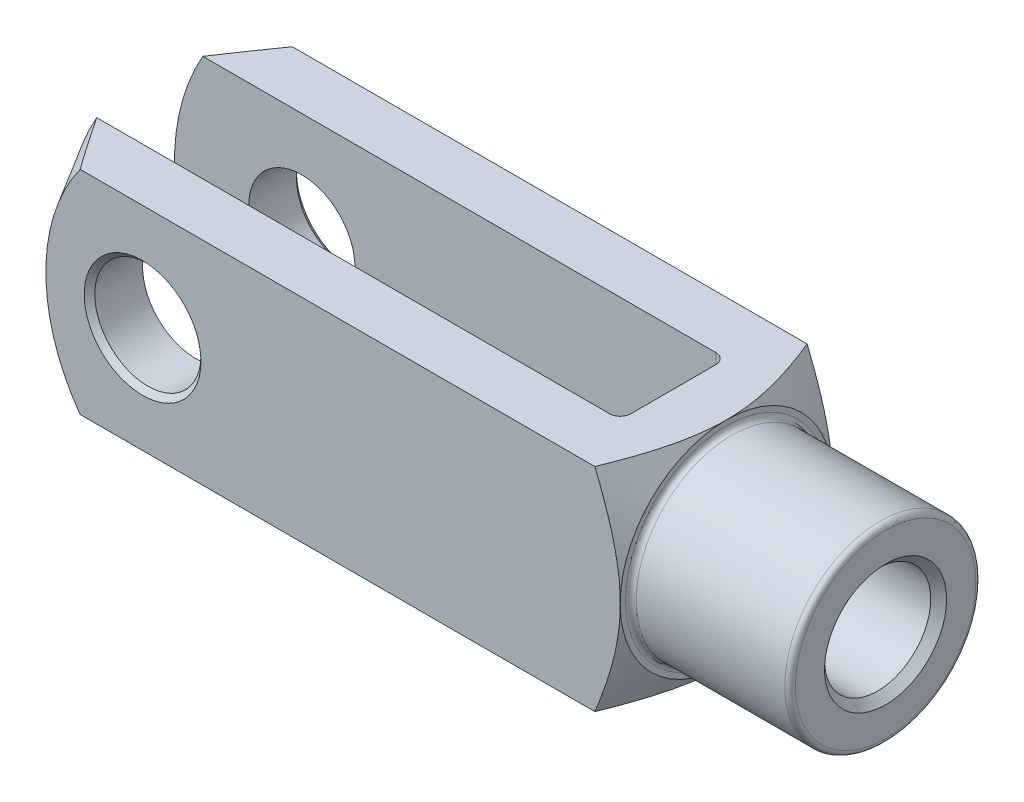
ISO-10303-21;
HEADER;
FILE_DESCRIPTION(('STEP AP214'),'2;1');
FILE_NAME('part.step','',(''),(''),'','','');
FILE_SCHEMA(('AUTOMOTIVE_DESIGN { 1 0 10303 214 1 1 1 1 }'));
ENDSEC;
DATA;
#1=APPLICATION_CONTEXT('core data for automotive mechanical design processes');
#2=APPLICATION_PROTOCOL_DEFINITION('international standard','automotive_design',2000,#1);
#3=PRODUCT_CONTEXT('',#1,'mechanical');
#4=PRODUCT('Part','Part','',(#3));
#5=PRODUCT_RELATED_PRODUCT_CATEGORY('part','',(#4));
#6=PRODUCT_DEFINITION_FORMATION('','',#4);
#7=PRODUCT_DEFINITION_CONTEXT('part definition',#1,'design');
#8=PRODUCT_DEFINITION('design','',#6,#7);
#9=PRODUCT_DEFINITION_SHAPE('','',#8);
#10=(LENGTH_UNIT() NAMED_UNIT(*) SI_UNIT(.MILLI.,.METRE.));
#11=(NAMED_UNIT(*) PLANE_ANGLE_UNIT() SI_UNIT($,.RADIAN.));
#12=(NAMED_UNIT(*) SI_UNIT($,.STERADIAN.) SOLID_ANGLE_UNIT());
#13=UNCERTAINTY_MEASURE_WITH_UNIT(LENGTH_MEASURE(1.E-05),#10,'distance_accuracy_value','');
#14=(GEOMETRIC_REPRESENTATION_CONTEXT(3) GLOBAL_UNCERTAINTY_ASSIGNED_CONTEXT((#13)) GLOBAL_UNIT_ASSIGNED_CONTEXT((#10,
#11,#12)) REPRESENTATION_CONTEXT('',''));
#15=CARTESIAN_POINT('',(0.,0.,0.));
#16=DIRECTION('',(0.,0.,1.));
#17=DIRECTION('',(1.,0.,0.));
#18=AXIS2_PLACEMENT_3D('',#15,#16,#17);
#19=CARTESIAN_POINT('',(-21.,-10.,-3.99999999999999));
#20=DIRECTION('',(0.,-1.,0.));
#21=DIRECTION('',(0.,0.,-1.));
#22=AXIS2_PLACEMENT_3D('',#19,#20,#21);
#23=CYLINDRICAL_SURFACE('',#22,1.);
#24=DIRECTION('',(0.,1.,0.));
#25=VECTOR('',#24,1.);
#26=CARTESIAN_POINT('',(-20.,-10.,-3.99999999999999));
#27=LINE('',#26,#25);
#28=CARTESIAN_POINT('',(-20.,-3.00000000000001,-3.99999999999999));
#29=VERTEX_POINT('',#28);
#30=CARTESIAN_POINT('',(-20.,-10.,-3.99999999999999));
#31=VERTEX_POINT('',#30);
#32=EDGE_CURVE('E357',#29,#31,#27,.F.);
#33=ORIENTED_EDGE('',*,*,#32,.F.);
#34=CARTESIAN_POINT('',(-20.,-3.00000000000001,-3.99999999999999));
#35=CARTESIAN_POINT('',(-20.0000371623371,-2.93694469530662,-4.04730456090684));
#36=CARTESIAN_POINT('',(-20.0033524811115,-2.87282528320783,-4.09305159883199));
#37=CARTESIAN_POINT('',(-20.0155357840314,-2.74298227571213,-4.18116773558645));
#38=CARTESIAN_POINT('',(-20.0243931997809,-2.67726196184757,-4.22354309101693));
#39=CARTESIAN_POINT('',(-20.0465893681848,-2.54494770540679,-4.30455906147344));
#40=CARTESIAN_POINT('',(-20.0598973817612,-2.47836268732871,-4.34322301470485));
#41=CARTESIAN_POINT('',(-20.0902730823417,-2.34411430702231,-4.41712604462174));
#42=CARTESIAN_POINT('',(-20.1073432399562,-2.27645026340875,-4.45236284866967));
#43=CARTESIAN_POINT('',(-20.1564689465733,-2.09692992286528,-4.54073885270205));
#44=CARTESIAN_POINT('',(-20.1911463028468,-1.98436263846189,-4.59099447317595));
#45=CARTESIAN_POINT('',(-20.2666906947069,-1.75765553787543,-4.68247844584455));
#46=CARTESIAN_POINT('',(-20.3075603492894,-1.64351507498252,-4.72370296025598));
#47=CARTESIAN_POINT('',(-20.3940114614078,-1.4136948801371,-4.79750849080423));
#48=CARTESIAN_POINT('',(-20.4396106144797,-1.29801088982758,-4.8300552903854));
#49=CARTESIAN_POINT('',(-20.5340479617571,-1.06592793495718,-4.88651783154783));
#50=CARTESIAN_POINT('',(-20.5828851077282,-0.949529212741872,-4.91043635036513));
#51=CARTESIAN_POINT('',(-20.6911535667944,-0.696523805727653,-4.95317913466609));
#52=CARTESIAN_POINT('',(-20.7509805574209,-0.559826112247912,-4.9704595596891));
#53=CARTESIAN_POINT('',(-20.8719499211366,-0.286372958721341,-4.99367348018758));
#54=CARTESIAN_POINT('',(-20.9330893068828,-0.149618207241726,-4.9996304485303));
#55=CARTESIAN_POINT('',(-20.9961510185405,-0.00860658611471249,-4.99999444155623));
#56=CARTESIAN_POINT('',(-20.9980755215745,-0.00430326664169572,-4.99999999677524));
#57=CARTESIAN_POINT('',(-21.,0.,-5.));
#58=B_SPLINE_CURVE_WITH_KNOTS('',3,(#34,#35,#36,#37,#38,#39,#40,#41,#42,#43,#44,#45,#46,#47,#48,
#49,#50,#51,#52,#53,#54,#55,#56,#57),.UNSPECIFIED.,.F.,.F.,(4,2,2,2,2,2,2,2,2,2,2,4),(0.,
0.236272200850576,0.472095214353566,0.706321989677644,0.940703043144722,1.3242927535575,
1.70804515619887,2.09328905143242,2.47840883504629,2.92860728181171,3.37787147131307,
3.39201361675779),.UNSPECIFIED.);
#59=CARTESIAN_POINT('',(-21.,0.,-5.));
#60=VERTEX_POINT('',#59);
#61=EDGE_CURVE('E391',#29,#60,#58,.T.);
#62=ORIENTED_EDGE('',*,*,#61,.T.);
#63=DIRECTION('',(0.,1.,0.));
#64=VECTOR('',#63,1.);
#65=CARTESIAN_POINT('',(-21.,10.,-4.99999999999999));
#66=LINE('',#65,#64);
#67=CARTESIAN_POINT('',(-21.,-10.,-4.99999999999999));
#68=VERTEX_POINT('',#67);
#69=EDGE_CURVE('E182',#68,#60,#66,.T.);
#70=ORIENTED_EDGE('',*,*,#69,.F.);
#71=CARTESIAN_POINT('',(-21.,-10.,-3.99999999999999));
#72=DIRECTION('',(0.,-1.,0.));
#73=DIRECTION('',(0.,0.,-1.));
#74=AXIS2_PLACEMENT_3D('',#71,#72,#73);
#75=CIRCLE('',#74,1.);
#76=EDGE_CURVE('E197',#31,#68,#75,.F.);
#77=ORIENTED_EDGE('',*,*,#76,.F.);
#78=EDGE_LOOP('',(#33,#62,#70,#77));
#79=FACE_BOUND('',#78,.T.);
#80=ADVANCED_FACE('F37',(#79),#23,.F.);
#81=CARTESIAN_POINT('',(-20.,-10.,-4.99999999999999));
#82=DIRECTION('',(1.,0.,0.));
#83=DIRECTION('',(0.,0.,-1.));
#84=AXIS2_PLACEMENT_3D('',#81,#82,#83);
#85=PLANE('',#84);
#86=CARTESIAN_POINT('',(-20.,10.,-3.99999999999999));
#87=VERTEX_POINT('',#86);
#88=CARTESIAN_POINT('',(-20.,3.00000000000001,-3.99999999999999));
#89=VERTEX_POINT('',#88);
#90=EDGE_CURVE('E373',#87,#89,#27,.F.);
#91=ORIENTED_EDGE('',*,*,#90,.T.);
#92=CARTESIAN_POINT('',(-20.,0.,0.));
#93=DIRECTION('',(1.,0.,0.));
#94=DIRECTION('',(0.,0.,-1.));
#95=AXIS2_PLACEMENT_3D('',#92,#93,#94);
#96=CIRCLE('',#95,5.);
#97=CARTESIAN_POINT('',(-20.,3.00000000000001,4.));
#98=VERTEX_POINT('',#97);
#99=EDGE_CURVE('E420',#89,#98,#96,.T.);
#100=ORIENTED_EDGE('',*,*,#99,.T.);
#101=DIRECTION('',(0.,1.,0.));
#102=VECTOR('',#101,1.);
#103=CARTESIAN_POINT('',(-20.,10.,3.99999999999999));
#104=LINE('',#103,#102);
#105=CARTESIAN_POINT('',(-20.,10.,3.99999999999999));
#106=VERTEX_POINT('',#105);
#107=EDGE_CURVE('E160',#98,#106,#104,.T.);
#108=ORIENTED_EDGE('',*,*,#107,.T.);
#109=DIRECTION('',(0.,0.,-1.));
#110=VECTOR('',#109,1.);
#111=CARTESIAN_POINT('',(-20.,10.,-4.99999999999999));
#112=LINE('',#111,#110);
#113=EDGE_CURVE('E338',#106,#87,#112,.T.);
#114=ORIENTED_EDGE('',*,*,#113,.T.);
#115=EDGE_LOOP('',(#91,#100,#108,#114));
#116=FACE_BOUND('',#115,.T.);
#117=ADVANCED_FACE('F460',(#116),#85,.F.);
#118=CARTESIAN_POINT('',(-21.,-10.,3.99999999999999));
#119=DIRECTION('',(0.,-1.,0.));
#120=DIRECTION('',(0.,0.,-1.));
#121=AXIS2_PLACEMENT_3D('',#118,#119,#120);
#122=CYLINDRICAL_SURFACE('',#121,1.);
#123=ORIENTED_EDGE('',*,*,#107,.F.);
#124=CARTESIAN_POINT('',(-20.,3.00000000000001,3.99999999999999));
#125=CARTESIAN_POINT('',(-20.0000371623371,2.93694469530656,4.04730456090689));
#126=CARTESIAN_POINT('',(-20.0033524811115,2.8728252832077,4.09305159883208));
#127=CARTESIAN_POINT('',(-20.0155357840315,2.74298227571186,4.18116773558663));
#128=CARTESIAN_POINT('',(-20.0243931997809,2.67726196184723,4.22354309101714));
#129=CARTESIAN_POINT('',(-20.0465893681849,2.54494770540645,4.30455906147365));
#130=CARTESIAN_POINT('',(-20.0598973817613,2.47836268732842,4.34322301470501));
#131=CARTESIAN_POINT('',(-20.0902730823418,2.34411430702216,4.41712604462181));
#132=CARTESIAN_POINT('',(-20.1073432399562,2.27645026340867,4.45236284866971));
#133=CARTESIAN_POINT('',(-20.1564689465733,2.09692992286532,4.54073885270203));
#134=CARTESIAN_POINT('',(-20.1911463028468,1.98436263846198,4.59099447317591));
#135=CARTESIAN_POINT('',(-20.2666906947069,1.7576555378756,4.68247844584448));
#136=CARTESIAN_POINT('',(-20.3075603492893,1.64351507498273,4.72370296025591));
#137=CARTESIAN_POINT('',(-20.3940114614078,1.41369488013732,4.79750849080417));
#138=CARTESIAN_POINT('',(-20.4396106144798,1.29801088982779,4.83005529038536));
#139=CARTESIAN_POINT('',(-20.534047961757,1.06592793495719,4.88651783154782));
#140=CARTESIAN_POINT('',(-20.5828851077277,0.949529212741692,4.91043635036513));
#141=CARTESIAN_POINT('',(-20.6911535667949,0.69652380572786,4.95317913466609));
#142=CARTESIAN_POINT('',(-20.7509805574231,0.559826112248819,4.97045955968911));
#143=CARTESIAN_POINT('',(-20.8719499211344,0.286372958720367,4.99367348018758));
#144=CARTESIAN_POINT('',(-20.9330893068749,0.149618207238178,4.99963044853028));
#145=CARTESIAN_POINT('',(-20.99615101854,0.00860658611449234,4.99999444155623));
#146=CARTESIAN_POINT('',(-20.9980755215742,0.00430326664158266,4.99999999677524));
#147=CARTESIAN_POINT('',(-21.,0.,5.));
#148=B_SPLINE_CURVE_WITH_KNOTS('',3,(#124,#125,#126,#127,#128,#129,#130,#131,#132,#133,#134,
#135,#136,#137,#138,#139,#140,#141,#142,#143,#144,#145,#146,#147),.UNSPECIFIED.,.F.,.F.,(4,2,2,
2,2,2,2,2,2,2,2,4),(0.,0.236272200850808,0.472095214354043,0.706321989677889,0.940703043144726,
1.32429275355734,1.70804515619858,2.0932890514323,2.47840883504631,2.92860728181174,
3.37787147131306,3.39201361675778),.UNSPECIFIED.);
#149=CARTESIAN_POINT('',(-21.,0.,5.));
#150=VERTEX_POINT('',#149);
#151=EDGE_CURVE('E145',#98,#150,#148,.T.);
#152=ORIENTED_EDGE('',*,*,#151,.T.);
#153=DIRECTION('',(0.,1.,0.));
#154=VECTOR('',#153,1.);
#155=CARTESIAN_POINT('',(-21.,-10.,5.));
#156=LINE('',#155,#154);
#157=CARTESIAN_POINT('',(-21.,10.,5.));
#158=VERTEX_POINT('',#157);
#159=EDGE_CURVE('E159',#158,#150,#156,.F.);
#160=ORIENTED_EDGE('',*,*,#159,.F.);
#161=CARTESIAN_POINT('',(-21.,10.,3.99999999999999));
#162=DIRECTION('',(0.,1.,0.));
#163=DIRECTION('',(0.,0.,1.));
#164=AXIS2_PLACEMENT_3D('',#161,#162,#163);
#165=CIRCLE('',#164,1.);
#166=EDGE_CURVE('E189',#106,#158,#165,.F.);
#167=ORIENTED_EDGE('',*,*,#166,.F.);
#168=EDGE_LOOP('',(#123,#152,#160,#167));
#169=FACE_BOUND('',#168,.T.);
#170=ADVANCED_FACE('F156',(#169),#122,.F.);
#171=CARTESIAN_POINT('',(-72.,-10.,-4.99999999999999));
#172=DIRECTION('',(0.,0.,-1.));
#173=DIRECTION('',(-1.,0.,0.));
#174=AXIS2_PLACEMENT_3D('',#171,#172,#173);
#175=PLANE('',#174);
#176=CARTESIAN_POINT('',(-60.,0.,-4.99999999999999));
#177=DIRECTION('',(0.,0.,-1.));
#178=DIRECTION('',(-1.,0.,0.));
#179=AXIS2_PLACEMENT_3D('',#176,#177,#178);
#180=CIRCLE('',#179,5.);
#181=CARTESIAN_POINT('',(-65.,0.,-4.99999999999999));
#182=VERTEX_POINT('',#181);
#183=EDGE_CURVE('E367',#182,#182,#180,.F.);
#184=ORIENTED_EDGE('',*,*,#183,.F.);
#185=EDGE_LOOP('',(#184));
#186=FACE_BOUND('',#185,.T.);
#187=CARTESIAN_POINT('',(-52.,0.,-4.99999999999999));
#188=DIRECTION('',(0.,0.,1.));
#189=DIRECTION('',(1.,0.,0.));
#190=AXIS2_PLACEMENT_3D('',#187,#188,#189);
#191=CIRCLE('',#190,20.);
#192=CARTESIAN_POINT('',(-69.3205080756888,10.,-4.99999999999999));
#193=VERTEX_POINT('',#192);
#194=CARTESIAN_POINT('',(-69.3205080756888,-10.,-4.99999999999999));
#195=VERTEX_POINT('',#194);
#196=EDGE_CURVE('E276',#193,#195,#191,.T.);
#197=ORIENTED_EDGE('',*,*,#196,.T.);
#198=DIRECTION('',(-1.,0.,0.));
#199=VECTOR('',#198,1.);
#200=CARTESIAN_POINT('',(-72.,-10.,-4.99999999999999));
#201=LINE('',#200,#199);
#202=EDGE_CURVE('E333',#68,#195,#201,.T.);
#203=ORIENTED_EDGE('',*,*,#202,.F.);
#204=ORIENTED_EDGE('',*,*,#69,.T.);
#205=CARTESIAN_POINT('',(-21.,10.,-4.99999999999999));
#206=VERTEX_POINT('',#205);
#207=EDGE_CURVE('E179',#60,#206,#66,.T.);
#208=ORIENTED_EDGE('',*,*,#207,.T.);
#209=DIRECTION('',(-1.,0.,0.));
#210=VECTOR('',#209,1.);
#211=CARTESIAN_POINT('',(-72.,10.,-4.99999999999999));
#212=LINE('',#211,#210);
#213=EDGE_CURVE('E346',#206,#193,#212,.T.);
#214=ORIENTED_EDGE('',*,*,#213,.T.);
#215=EDGE_LOOP('',(#197,#203,#204,#208,#214));
#216=FACE_BOUND('',#215,.T.);
#217=ADVANCED_FACE('F394',(#186,#216),#175,.F.);
#218=CARTESIAN_POINT('',(-72.,-10.,5.00000000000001));
#219=DIRECTION('',(0.,0.,1.));
#220=DIRECTION('',(1.,0.,0.));
#221=AXIS2_PLACEMENT_3D('',#218,#219,#220);
#222=PLANE('',#221);
#223=CARTESIAN_POINT('',(-60.,0.,5.00000000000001));
#224=DIRECTION('',(0.,0.,1.));
#225=DIRECTION('',(1.,0.,0.));
#226=AXIS2_PLACEMENT_3D('',#223,#224,#225);
#227=CIRCLE('',#226,5.);
#228=CARTESIAN_POINT('',(-55.,0.,5.00000000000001));
#229=VERTEX_POINT('',#228);
#230=EDGE_CURVE('E345',#229,#229,#227,.F.);
#231=ORIENTED_EDGE('',*,*,#230,.F.);
#232=EDGE_LOOP('',(#231));
#233=FACE_BOUND('',#232,.T.);
#234=DIRECTION('',(1.,0.,0.));
#235=VECTOR('',#234,1.);
#236=CARTESIAN_POINT('',(-72.,-10.,5.00000000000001));
#237=LINE('',#236,#235);
#238=CARTESIAN_POINT('',(-69.3205080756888,-10.,5.00000000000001));
#239=VERTEX_POINT('',#238);
#240=CARTESIAN_POINT('',(-21.,-10.,5.));
#241=VERTEX_POINT('',#240);
#242=EDGE_CURVE('E337',#239,#241,#237,.T.);
#243=ORIENTED_EDGE('',*,*,#242,.F.);
#244=CARTESIAN_POINT('',(-52.,0.,5.00000000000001));
#245=DIRECTION('',(0.,0.,1.));
#246=DIRECTION('',(1.,0.,0.));
#247=AXIS2_PLACEMENT_3D('',#244,#245,#246);
#248=CIRCLE('',#247,20.);
#249=CARTESIAN_POINT('',(-69.3205080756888,10.,5.00000000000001));
#250=VERTEX_POINT('',#249);
#251=EDGE_CURVE('E414',#250,#239,#248,.T.);
#252=ORIENTED_EDGE('',*,*,#251,.F.);
#253=DIRECTION('',(1.,0.,0.));
#254=VECTOR('',#253,1.);
#255=CARTESIAN_POINT('',(-72.,10.,5.00000000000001));
#256=LINE('',#255,#254);
#257=EDGE_CURVE('E176',#250,#158,#256,.T.);
#258=ORIENTED_EDGE('',*,*,#257,.T.);
#259=ORIENTED_EDGE('',*,*,#159,.T.);
#260=EDGE_CURVE('E164',#150,#241,#156,.F.);
#261=ORIENTED_EDGE('',*,*,#260,.T.);
#262=EDGE_LOOP('',(#243,#252,#258,#259,#261));
#263=FACE_BOUND('',#262,.T.);
#264=ADVANCED_FACE('F173',(#233,#263),#222,.F.);
#265=CARTESIAN_POINT('',(-72.,-10.,10.));
#266=DIRECTION('',(0.,0.,1.));
#267=DIRECTION('',(1.,0.,0.));
#268=AXIS2_PLACEMENT_3D('',#265,#266,#267);
#269=PLANE('',#268);
#270=CARTESIAN_POINT('',(-60.,0.,10.));
#271=DIRECTION('',(0.,0.,1.));
#272=DIRECTION('',(1.,0.,0.));
#273=AXIS2_PLACEMENT_3D('',#270,#271,#272);
#274=CIRCLE('',#273,5.50000000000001);
#275=CARTESIAN_POINT('',(-54.5,0.,10.));
#276=VERTEX_POINT('',#275);
#277=EDGE_CURVE('E228',#276,#276,#274,.F.);
#278=ORIENTED_EDGE('',*,*,#277,.T.);
#279=EDGE_LOOP('',(#278));
#280=FACE_BOUND('',#279,.T.);
#281=DIRECTION('',(1.,0.,0.));
#282=VECTOR('',#281,1.);
#283=CARTESIAN_POINT('',(-72.,10.,10.));
#284=LINE('',#283,#282);
#285=CARTESIAN_POINT('',(-65.8875224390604,10.,10.));
#286=VERTEX_POINT('',#285);
#287=CARTESIAN_POINT('',(-17.391463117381,10.,10.));
#288=VERTEX_POINT('',#287);
#289=EDGE_CURVE('E364',#286,#288,#284,.T.);
#290=ORIENTED_EDGE('',*,*,#289,.F.);
#291=CARTESIAN_POINT('',(-52.,0.,10.));
#292=DIRECTION('',(0.,0.,1.));
#293=DIRECTION('',(1.,0.,0.));
#294=AXIS2_PLACEMENT_3D('',#291,#292,#293);
#295=CIRCLE('',#294,17.1132486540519);
#296=CARTESIAN_POINT('',(-65.8875224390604,-10.,10.));
#297=VERTEX_POINT('',#296);
#298=EDGE_CURVE('E61',#286,#297,#295,.T.);
#299=ORIENTED_EDGE('',*,*,#298,.T.);
#300=DIRECTION('',(1.,0.,0.));
#301=VECTOR('',#300,1.);
#302=CARTESIAN_POINT('',(-72.,-10.,10.));
#303=LINE('',#302,#301);
#304=CARTESIAN_POINT('',(-17.391463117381,-10.,10.));
#305=VERTEX_POINT('',#304);
#306=EDGE_CURVE('E361',#297,#305,#303,.T.);
#307=ORIENTED_EDGE('',*,*,#306,.T.);
#308=CARTESIAN_POINT('',(-22.3558734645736,-20.4240435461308,10.));
#309=CARTESIAN_POINT('',(-22.1003465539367,-19.9311836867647,10.));
#310=CARTESIAN_POINT('',(-21.8461705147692,-19.4376169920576,10.));
#311=CARTESIAN_POINT('',(-21.3412365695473,-18.4487061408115,10.));
#312=CARTESIAN_POINT('',(-21.0904788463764,-17.9533618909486,10.));
#313=CARTESIAN_POINT('',(-20.5926922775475,-16.9597202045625,10.));
#314=CARTESIAN_POINT('',(-20.3456706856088,-16.4614191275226,10.));
#315=CARTESIAN_POINT('',(-19.8568264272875,-15.4622801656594,10.));
#316=CARTESIAN_POINT('',(-19.6150036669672,-14.9614423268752,10.));
#317=CARTESIAN_POINT('',(-19.1232043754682,-13.9257515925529,10.));
#318=CARTESIAN_POINT('',(-18.8736415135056,-13.3907016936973,10.));
#319=CARTESIAN_POINT('',(-18.3840144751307,-12.3162208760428,10.));
#320=CARTESIAN_POINT('',(-18.1439507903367,-11.7767897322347,10.));
#321=CARTESIAN_POINT('',(-17.6764473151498,-10.6927476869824,10.));
#322=CARTESIAN_POINT('',(-17.4490019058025,-10.1481392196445,10.));
#323=CARTESIAN_POINT('',(-17.0108100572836,-9.05224110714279,10.));
#324=CARTESIAN_POINT('',(-16.8000616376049,-8.50095226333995,10.));
#325=CARTESIAN_POINT('',(-16.4792530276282,-7.60769970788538,10.));
#326=CARTESIAN_POINT('',(-16.3620787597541,-7.26829451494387,10.));
#327=CARTESIAN_POINT('',(-16.1378183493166,-6.58617800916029,10.));
#328=CARTESIAN_POINT('',(-16.0307313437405,-6.24346698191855,10.));
#329=CARTESIAN_POINT('',(-15.828626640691,-5.55448777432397,10.));
#330=CARTESIAN_POINT('',(-15.733608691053,-5.2082196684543,10.));
#331=CARTESIAN_POINT('',(-15.5579131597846,-4.51203468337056,10.));
#332=CARTESIAN_POINT('',(-15.4772354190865,-4.16211784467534,10.));
#333=CARTESIAN_POINT('',(-15.3343492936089,-3.46705706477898,10.));
#334=CARTESIAN_POINT('',(-15.2717518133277,-3.12199390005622,10.));
#335=CARTESIAN_POINT('',(-15.1647579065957,-2.42903327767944,10.));
#336=CARTESIAN_POINT('',(-15.1203608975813,-2.08113591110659,10.));
#337=CARTESIAN_POINT('',(-15.0516237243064,-1.38356903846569,10.));
#338=CARTESIAN_POINT('',(-15.0272704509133,-1.03390084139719,10.));
#339=CARTESIAN_POINT('',(-14.9996951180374,-0.333728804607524,10.));
#340=CARTESIAN_POINT('',(-14.9964723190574,0.0167750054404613,10.));
#341=CARTESIAN_POINT('',(-15.010762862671,0.691790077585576,10.));
#342=CARTESIAN_POINT('',(-15.0267823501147,1.01633432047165,10.));
#343=CARTESIAN_POINT('',(-15.0764553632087,1.66405607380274,10.));
#344=CARTESIAN_POINT('',(-15.1101088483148,1.98723358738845,10.));
#345=CARTESIAN_POINT('',(-15.1938161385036,2.63160306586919,10.));
#346=CARTESIAN_POINT('',(-15.2438784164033,2.95279391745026,10.));
#347=CARTESIAN_POINT('',(-15.3587527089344,3.59250988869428,10.));
#348=CARTESIAN_POINT('',(-15.4235651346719,3.91103493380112,10.));
#349=CARTESIAN_POINT('',(-15.5682001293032,4.55432870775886,10.));
#350=CARTESIAN_POINT('',(-15.6484028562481,4.87901130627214,10.));
#351=CARTESIAN_POINT('',(-15.8205817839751,5.52521807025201,10.));
#352=CARTESIAN_POINT('',(-15.9125580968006,5.84674220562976,10.));
#353=CARTESIAN_POINT('',(-16.1065044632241,6.48673250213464,10.));
#354=CARTESIAN_POINT('',(-16.2084740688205,6.80519879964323,10.));
#355=CARTESIAN_POINT('',(-16.3677555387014,7.28075232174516,10.));
#356=CARTESIAN_POINT('',(-16.4219029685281,7.43891003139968,10.));
#357=CARTESIAN_POINT('',(-16.5321392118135,7.75454715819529,10.));
#358=CARTESIAN_POINT('',(-16.5882280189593,7.91202657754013,10.));
#359=CARTESIAN_POINT('',(-16.7684482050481,8.40910944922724,10.));
#360=CARTESIAN_POINT('',(-16.8958517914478,8.74752927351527,10.));
#361=CARTESIAN_POINT('',(-17.1575763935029,9.42169147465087,10.));
#362=CARTESIAN_POINT('',(-17.2918978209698,9.75743369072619,10.));
#363=CARTESIAN_POINT('',(-17.5663381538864,10.4266152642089,10.));
#364=CARTESIAN_POINT('',(-17.7064582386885,10.7600541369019,10.));
#365=CARTESIAN_POINT('',(-17.9915396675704,11.4248600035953,10.));
#366=CARTESIAN_POINT('',(-18.1365011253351,11.7562269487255,10.));
#367=CARTESIAN_POINT('',(-18.4306248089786,12.4174211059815,10.));
#368=CARTESIAN_POINT('',(-18.579790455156,12.7472467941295,10.));
#369=CARTESIAN_POINT('',(-18.8815899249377,13.4053092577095,10.));
#370=CARTESIAN_POINT('',(-19.0342237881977,13.7335460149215,10.));
#371=CARTESIAN_POINT('',(-19.496500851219,14.7160981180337,10.));
#372=CARTESIAN_POINT('',(-19.8105565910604,15.3683378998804,10.));
#373=CARTESIAN_POINT('',(-20.4483163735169,16.6705289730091,10.));
#374=CARTESIAN_POINT('',(-20.7720469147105,17.3204672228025,10.));
#375=CARTESIAN_POINT('',(-21.4261391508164,18.6170111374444,10.));
#376=CARTESIAN_POINT('',(-21.7565009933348,19.2636167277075,10.));
#377=CARTESIAN_POINT('',(-22.4221745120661,20.5538665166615,10.));
#378=CARTESIAN_POINT('',(-22.7574836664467,21.197512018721,10.));
#379=CARTESIAN_POINT('',(-23.4321254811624,22.4826820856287,10.));
#380=CARTESIAN_POINT('',(-23.7714581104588,23.1242066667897,10.));
#381=CARTESIAN_POINT('',(-24.6929935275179,24.8559334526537,10.));
#382=CARTESIAN_POINT('',(-25.2782369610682,25.9445168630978,10.));
#383=CARTESIAN_POINT('',(-26.4553238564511,28.1183008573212,10.));
#384=CARTESIAN_POINT('',(-27.0471682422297,29.2035009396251,10.));
#385=CARTESIAN_POINT('',(-28.232230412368,31.3650726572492,10.));
#386=CARTESIAN_POINT('',(-28.8254209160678,32.4414592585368,10.));
#387=CARTESIAN_POINT('',(-29.7178280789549,34.0544764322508,10.));
#388=CARTESIAN_POINT('',(-30.0157104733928,34.5918461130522,10.));
#389=CARTESIAN_POINT('',(-30.6122603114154,35.666148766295,10.));
#390=CARTESIAN_POINT('',(-30.9109277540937,36.2030817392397,10.));
#391=CARTESIAN_POINT('',(-31.2099360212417,36.7398248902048,10.));
#392=B_SPLINE_CURVE_WITH_KNOTS('',3,(#308,#309,#310,#311,#312,#313,#314,#315,#316,#317,#318,
#319,#320,#321,#322,#323,#324,#325,#326,#327,#328,#329,#330,#331,#332,#333,#334,#335,#336,#337,
#338,#339,#340,#341,#342,#343,#344,#345,#346,#347,#348,#349,#350,#351,#352,#353,#354,#355,#356,
#357,#358,#359,#360,#361,#362,#363,#364,#365,#366,#367,#368,#369,#370,#371,#372,#373,#374,#375,
#376,#377,#378,#379,#380,#381,#382,#383,#384,#385,#386,#387,#388,#389,#390,#391),.UNSPECIFIED.,
.F.,.F.,(4,2,2,2,2,2,2,2,2,2,2,2,2,2,2,2,2,2,2,2,2,2,2,2,2,2,2,2,2,2,2,2,2,2,2,2,2,2,2,2,2,4),
(0.,1.66549246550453,3.33107368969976,4.99955529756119,6.66800673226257,8.43910594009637,
10.2102966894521,11.980692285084,13.7508775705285,14.8279395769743,15.9049093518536,
16.9818566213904,18.0587919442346,19.1104471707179,20.162068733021,21.2130019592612,
22.2638984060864,23.2382198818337,24.2125391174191,25.1873622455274,26.1622125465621,
27.1652790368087,28.1683550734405,29.1713861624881,29.6728858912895,30.1743839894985,
31.2591028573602,32.3438863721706,33.4288916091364,34.5139223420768,35.59986283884,
36.685815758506,38.857450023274,41.0357057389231,43.2140099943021,45.3912398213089,
47.5684528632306,51.2762079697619,54.9844887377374,58.6715305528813,60.5147611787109,
62.3579896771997),.UNSPECIFIED.);
#393=CARTESIAN_POINT('',(-15.,0.,10.));
#394=VERTEX_POINT('',#393);
#395=EDGE_CURVE('E305',#394,#305,#392,.F.);
#396=ORIENTED_EDGE('',*,*,#395,.F.);
#397=EDGE_CURVE('E303',#288,#394,#392,.F.);
#398=ORIENTED_EDGE('',*,*,#397,.F.);
#399=EDGE_LOOP('',(#290,#299,#307,#396,#398));
#400=FACE_BOUND('',#399,.T.);
#401=ADVANCED_FACE('F287',(#280,#400),#269,.T.);
#402=CARTESIAN_POINT('',(-72.,-10.,10.));
#403=DIRECTION('',(0.,-1.,0.));
#404=DIRECTION('',(0.,0.,-1.));
#405=AXIS2_PLACEMENT_3D('',#402,#403,#404);
#406=PLANE('',#405);
#407=ORIENTED_EDGE('',*,*,#202,.T.);
#408=CARTESIAN_POINT('',(-77.2321898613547,-10.,7.36951687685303));
#409=CARTESIAN_POINT('',(-76.745633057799,-10.,6.58611648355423));
#410=CARTESIAN_POINT('',(-76.2577437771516,-10.,5.80353993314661));
#411=CARTESIAN_POINT('',(-75.2786767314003,-10.,4.24042523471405));
#412=CARTESIAN_POINT('',(-74.7874989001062,-10.,3.45988712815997));
#413=CARTESIAN_POINT('',(-73.8006621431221,-10.,1.9003413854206));
#414=CARTESIAN_POINT('',(-73.3049985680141,-10.,1.12133668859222));
#415=CARTESIAN_POINT('',(-72.3089364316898,-10.,-0.433632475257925));
#416=CARTESIAN_POINT('',(-71.8085379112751,-10.,-1.20959696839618));
#417=CARTESIAN_POINT('',(-70.780963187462,-10.,-2.78997730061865));
#418=CARTESIAN_POINT('',(-70.2535395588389,-10.,-3.59423250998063));
#419=CARTESIAN_POINT('',(-69.1907284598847,-10.,-5.19745714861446));
#420=CARTESIAN_POINT('',(-68.6553410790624,-10.,-5.99642663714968));
#421=CARTESIAN_POINT('',(-67.5747096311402,-10.,-7.58683469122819));
#422=CARTESIAN_POINT('',(-67.0294731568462,-10.,-8.37827839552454));
#423=CARTESIAN_POINT('',(-66.2014533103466,-10.,-9.55828753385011));
#424=CARTESIAN_POINT('',(-65.9237578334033,-10.,-9.95042385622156));
#425=CARTESIAN_POINT('',(-65.3644017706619,-10.,-10.7318561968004));
#426=CARTESIAN_POINT('',(-65.0827412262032,-10.,-11.1211522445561));
#427=CARTESIAN_POINT('',(-64.5174190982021,-10.,-11.8927308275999));
#428=CARTESIAN_POINT('',(-64.2338006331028,-10.,-12.2750449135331));
#429=CARTESIAN_POINT('',(-63.6611630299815,-10.,-13.0356258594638));
#430=CARTESIAN_POINT('',(-63.3721437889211,-10.,-13.4138926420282));
#431=CARTESIAN_POINT('',(-62.787258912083,-10.,-14.1659406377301));
#432=CARTESIAN_POINT('',(-62.4913844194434,-10.,-14.5397149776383));
#433=CARTESIAN_POINT('',(-61.8918382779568,-10.,-15.2809455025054));
#434=CARTESIAN_POINT('',(-61.5881670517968,-10.,-15.6484020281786));
#435=CARTESIAN_POINT('',(-60.9744614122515,-10.,-16.3714518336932));
#436=CARTESIAN_POINT('',(-60.6645256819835,-10.,-16.7271286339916));
#437=CARTESIAN_POINT('',(-60.0329680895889,-10.,-17.4282054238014));
#438=CARTESIAN_POINT('',(-59.7113432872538,-10.,-17.7736027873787));
#439=CARTESIAN_POINT('',(-59.2183551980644,-10.,-18.2807263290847));
#440=CARTESIAN_POINT('',(-59.0524514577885,-10.,-18.4477649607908));
#441=CARTESIAN_POINT('',(-58.716558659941,-10.,-18.7776754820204));
#442=CARTESIAN_POINT('',(-58.5465698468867,-10.,-18.9405476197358));
#443=CARTESIAN_POINT('',(-58.2020749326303,-10.,-19.2612725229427));
#444=CARTESIAN_POINT('',(-58.0275712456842,-10.,-19.4191278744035));
#445=CARTESIAN_POINT('',(-57.6733935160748,-10.,-19.7289072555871));
#446=CARTESIAN_POINT('',(-57.4937200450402,-10.,-19.8808319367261));
#447=CARTESIAN_POINT('',(-57.1220498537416,-10.,-20.1827912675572));
#448=CARTESIAN_POINT('',(-56.9298420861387,-10.,-20.3325675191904));
#449=CARTESIAN_POINT('',(-56.5383571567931,-10.,-20.6227066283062));
#450=CARTESIAN_POINT('',(-56.3390786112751,-10.,-20.7630676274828));
#451=CARTESIAN_POINT('',(-55.932846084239,-10.,-21.0319774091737));
#452=CARTESIAN_POINT('',(-55.7258982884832,-10.,-21.160535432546));
#453=CARTESIAN_POINT('',(-55.3037021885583,-10.,-21.4030294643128));
#454=CARTESIAN_POINT('',(-55.0884560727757,-10.,-21.5169692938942));
#455=CARTESIAN_POINT('',(-54.5296464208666,-10.,-21.7838098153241));
#456=CARTESIAN_POINT('',(-54.1798259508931,-10.,-21.9243079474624));
#457=CARTESIAN_POINT('',(-53.6418795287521,-10.,-22.0912640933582));
#458=CARTESIAN_POINT('',(-53.4604354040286,-10.,-22.1396072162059));
#459=CARTESIAN_POINT('',(-53.093915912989,-10.,-22.2200235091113));
#460=CARTESIAN_POINT('',(-52.908840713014,-10.,-22.2520974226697));
#461=CARTESIAN_POINT('',(-52.5346022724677,-10.,-22.2988166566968));
#462=CARTESIAN_POINT('',(-52.3454166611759,-10.,-22.313284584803));
#463=CARTESIAN_POINT('',(-51.9665401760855,-10.,-22.3235178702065));
#464=CARTESIAN_POINT('',(-51.7768493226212,-10.,-22.3192839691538));
#465=CARTESIAN_POINT('',(-51.3987646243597,-10.,-22.292316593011));
#466=CARTESIAN_POINT('',(-51.2103710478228,-10.,-22.2695794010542));
#467=CARTESIAN_POINT('',(-50.8365348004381,-10.,-22.2066526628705));
#468=CARTESIAN_POINT('',(-50.6510925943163,-10.,-22.1664603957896));
#469=CARTESIAN_POINT('',(-50.2504201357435,-10.,-22.0613497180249));
#470=CARTESIAN_POINT('',(-50.0360329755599,-10.,-21.9932307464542));
#471=CARTESIAN_POINT('',(-49.6142317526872,-10.,-21.8379822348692));
#472=CARTESIAN_POINT('',(-49.4068216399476,-10.,-21.750842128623));
#473=CARTESIAN_POINT('',(-48.9988371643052,-10.,-21.5605082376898));
#474=CARTESIAN_POINT('',(-48.7982845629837,-10.,-21.4572682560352));
#475=CARTESIAN_POINT('',(-48.4045157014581,-10.,-21.2378022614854));
#476=CARTESIAN_POINT('',(-48.211298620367,-10.,-21.121577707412));
#477=CARTESIAN_POINT('',(-47.7694245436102,-10.,-20.8386610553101));
#478=CARTESIAN_POINT('',(-47.5233696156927,-10.,-20.6679192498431));
#479=CARTESIAN_POINT('',(-47.0418236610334,-10.,-20.3120669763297));
#480=CARTESIAN_POINT('',(-46.8063377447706,-10.,-20.1269496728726));
#481=CARTESIAN_POINT('',(-46.3441491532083,-10.,-19.7452386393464));
#482=CARTESIAN_POINT('',(-46.1174642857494,-10.,-19.5486234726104));
#483=CARTESIAN_POINT('',(-45.6720928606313,-10.,-19.1466530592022));
#484=CARTESIAN_POINT('',(-45.453404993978,-10.,-18.941299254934));
#485=CARTESIAN_POINT('',(-45.0214181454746,-10.,-18.5221818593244));
#486=CARTESIAN_POINT('',(-44.8081650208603,-10.,-18.3083711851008));
#487=CARTESIAN_POINT('',(-44.3876033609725,-10.,-17.8749857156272));
#488=CARTESIAN_POINT('',(-44.1802950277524,-10.,-17.6554107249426));
#489=CARTESIAN_POINT('',(-43.7710307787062,-10.,-17.2117611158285));
#490=CARTESIAN_POINT('',(-43.5690695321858,-10.,-16.9876914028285));
#491=CARTESIAN_POINT('',(-43.169607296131,-10.,-16.5356277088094));
#492=CARTESIAN_POINT('',(-42.9721062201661,-10.,-16.3076338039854));
#493=CARTESIAN_POINT('',(-42.4999897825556,-10.,-15.7532280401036));
#494=CARTESIAN_POINT('',(-42.2273152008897,-10.,-15.4251642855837));
#495=CARTESIAN_POINT('',(-41.6883836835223,-10.,-14.7637172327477));
#496=CARTESIAN_POINT('',(-41.4221280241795,-10.,-14.4303328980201));
#497=CARTESIAN_POINT('',(-40.899094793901,-10.,-13.7644395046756));
#498=CARTESIAN_POINT('',(-40.6422345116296,-10.,-13.4319952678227));
#499=CARTESIAN_POINT('',(-40.1331161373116,-10.,-12.7637580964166));
#500=CARTESIAN_POINT('',(-39.8808566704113,-10.,-12.4279662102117));
#501=CARTESIAN_POINT('',(-39.6304831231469,-10.,-12.0907921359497));
#502=B_SPLINE_CURVE_WITH_KNOTS('',3,(#408,#409,#410,#411,#412,#413,#414,#415,#416,#417,#418,
#419,#420,#421,#422,#423,#424,#425,#426,#427,#428,#429,#430,#431,#432,#433,#434,#435,#436,#437,
#438,#439,#440,#441,#442,#443,#444,#445,#446,#447,#448,#449,#450,#451,#452,#453,#454,#455,#456,
#457,#458,#459,#460,#461,#462,#463,#464,#465,#466,#467,#468,#469,#470,#471,#472,#473,#474,#475,
#476,#477,#478,#479,#480,#481,#482,#483,#484,#485,#486,#487,#488,#489,#490,#491,#492,#493,#494,
#495,#496,#497,#498,#499,#500,#501),.UNSPECIFIED.,.F.,.F.,(4,2,2,2,2,2,2,2,2,2,2,2,2,2,2,2,2,2,
2,2,2,2,2,2,2,2,2,2,2,2,2,2,2,2,2,2,2,2,2,2,2,2,2,2,2,2,4),(0.,2.7666047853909,5.53326542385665,
8.30322881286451,11.0731683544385,13.9584410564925,16.843681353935,19.7267850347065,
21.1682825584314,22.6097650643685,24.0378123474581,25.465886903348,26.8959225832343,
28.3258808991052,29.7410059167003,31.1564893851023,31.8627134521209,32.5688953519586,
33.2747071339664,33.9804411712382,34.7112197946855,35.4421422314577,36.1724874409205,
36.9026413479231,38.0289522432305,38.5916651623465,39.1543523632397,39.7226632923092,
40.2909516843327,40.8593542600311,41.4278454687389,42.1016117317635,42.7757532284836,
43.4518659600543,44.1279028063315,45.0256730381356,45.9238727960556,46.8238041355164,
47.7235875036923,48.6293923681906,49.5352279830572,50.4401236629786,51.3450017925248,
52.6246585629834,53.9045677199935,55.1648707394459,56.4247907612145),.UNSPECIFIED.);
#503=CARTESIAN_POINT('',(-65.8875224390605,-10.,-10.));
#504=VERTEX_POINT('',#503);
#505=EDGE_CURVE('E275',#195,#504,#502,.T.);
#506=ORIENTED_EDGE('',*,*,#505,.T.);
#507=DIRECTION('',(1.,0.,0.));
#508=VECTOR('',#507,1.);
#509=CARTESIAN_POINT('',(-72.,-10.,-10.));
#510=LINE('',#509,#508);
#511=CARTESIAN_POINT('',(-17.391463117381,-10.,-10.));
#512=VERTEX_POINT('',#511);
#513=EDGE_CURVE('E358',#504,#512,#510,.T.);
#514=ORIENTED_EDGE('',*,*,#513,.T.);
#515=CARTESIAN_POINT('',(-22.3558734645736,-10.,-20.4240435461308));
#516=CARTESIAN_POINT('',(-22.1003465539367,-10.,-19.9311836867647));
#517=CARTESIAN_POINT('',(-21.8461705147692,-10.,-19.4376169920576));
#518=CARTESIAN_POINT('',(-21.3412365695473,-10.,-18.4487061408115));
#519=CARTESIAN_POINT('',(-21.0904788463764,-10.,-17.9533618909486));
#520=CARTESIAN_POINT('',(-20.5926922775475,-10.,-16.9597202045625));
#521=CARTESIAN_POINT('',(-20.3456706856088,-10.,-16.4614191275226));
#522=CARTESIAN_POINT('',(-19.8568264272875,-10.,-15.4622801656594));
#523=CARTESIAN_POINT('',(-19.6150036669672,-10.,-14.9614423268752));
#524=CARTESIAN_POINT('',(-19.1232043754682,-10.,-13.9257515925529));
#525=CARTESIAN_POINT('',(-18.8736415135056,-10.,-13.3907016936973));
#526=CARTESIAN_POINT('',(-18.3840144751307,-10.,-12.3162208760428));
#527=CARTESIAN_POINT('',(-18.1439507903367,-10.,-11.7767897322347));
#528=CARTESIAN_POINT('',(-17.6764473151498,-10.,-10.6927476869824));
#529=CARTESIAN_POINT('',(-17.4490019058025,-10.,-10.1481392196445));
#530=CARTESIAN_POINT('',(-17.0108100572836,-10.,-9.05224110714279));
#531=CARTESIAN_POINT('',(-16.8000616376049,-10.,-8.50095226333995));
#532=CARTESIAN_POINT('',(-16.4792530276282,-10.,-7.60769970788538));
#533=CARTESIAN_POINT('',(-16.3620787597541,-10.,-7.26829451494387));
#534=CARTESIAN_POINT('',(-16.1378183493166,-10.,-6.58617800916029));
#535=CARTESIAN_POINT('',(-16.0307313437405,-10.,-6.24346698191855));
#536=CARTESIAN_POINT('',(-15.828626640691,-10.,-5.55448777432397));
#537=CARTESIAN_POINT('',(-15.733608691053,-10.,-5.2082196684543));
#538=CARTESIAN_POINT('',(-15.5579131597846,-10.,-4.51203468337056));
#539=CARTESIAN_POINT('',(-15.4772354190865,-10.,-4.16211784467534));
#540=CARTESIAN_POINT('',(-15.3343492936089,-10.,-3.46705706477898));
#541=CARTESIAN_POINT('',(-15.2717518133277,-10.,-3.12199390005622));
#542=CARTESIAN_POINT('',(-15.1647579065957,-10.,-2.42903327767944));
#543=CARTESIAN_POINT('',(-15.1203608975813,-10.,-2.08113591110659));
#544=CARTESIAN_POINT('',(-15.0516237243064,-10.,-1.38356903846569));
#545=CARTESIAN_POINT('',(-15.0272704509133,-10.,-1.03390084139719));
#546=CARTESIAN_POINT('',(-14.9996951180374,-10.,-0.333728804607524));
#547=CARTESIAN_POINT('',(-14.9964723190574,-10.,0.0167750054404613));
#548=CARTESIAN_POINT('',(-15.010762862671,-10.,0.691790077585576));
#549=CARTESIAN_POINT('',(-15.0267823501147,-10.,1.01633432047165));
#550=CARTESIAN_POINT('',(-15.0764553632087,-10.,1.66405607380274));
#551=CARTESIAN_POINT('',(-15.1101088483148,-10.,1.98723358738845));
#552=CARTESIAN_POINT('',(-15.1938161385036,-10.,2.63160306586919));
#553=CARTESIAN_POINT('',(-15.2438784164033,-10.,2.95279391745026));
#554=CARTESIAN_POINT('',(-15.3587527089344,-10.,3.59250988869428));
#555=CARTESIAN_POINT('',(-15.4235651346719,-10.,3.91103493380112));
#556=CARTESIAN_POINT('',(-15.5682001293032,-10.,4.55432870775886));
#557=CARTESIAN_POINT('',(-15.6484028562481,-10.,4.87901130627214));
#558=CARTESIAN_POINT('',(-15.8205817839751,-10.,5.52521807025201));
#559=CARTESIAN_POINT('',(-15.9125580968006,-10.,5.84674220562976));
#560=CARTESIAN_POINT('',(-16.1065044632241,-10.,6.48673250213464));
#561=CARTESIAN_POINT('',(-16.2084740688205,-10.,6.80519879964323));
#562=CARTESIAN_POINT('',(-16.3677555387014,-10.,7.28075232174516));
#563=CARTESIAN_POINT('',(-16.4219029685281,-10.,7.43891003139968));
#564=CARTESIAN_POINT('',(-16.5321392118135,-10.,7.75454715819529));
#565=CARTESIAN_POINT('',(-16.5882280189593,-10.,7.91202657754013));
#566=CARTESIAN_POINT('',(-16.7684482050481,-10.,8.40910944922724));
#567=CARTESIAN_POINT('',(-16.8958517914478,-10.,8.74752927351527));
#568=CARTESIAN_POINT('',(-17.1575763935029,-10.,9.42169147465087));
#569=CARTESIAN_POINT('',(-17.2918978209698,-10.,9.75743369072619));
#570=CARTESIAN_POINT('',(-17.5663381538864,-10.,10.4266152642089));
#571=CARTESIAN_POINT('',(-17.7064582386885,-10.,10.7600541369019));
#572=CARTESIAN_POINT('',(-17.9915396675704,-10.,11.4248600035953));
#573=CARTESIAN_POINT('',(-18.1365011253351,-10.,11.7562269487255));
#574=CARTESIAN_POINT('',(-18.4306248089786,-10.,12.4174211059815));
#575=CARTESIAN_POINT('',(-18.579790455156,-10.,12.7472467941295));
#576=CARTESIAN_POINT('',(-18.8815899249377,-10.,13.4053092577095));
#577=CARTESIAN_POINT('',(-19.0342237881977,-10.,13.7335460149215));
#578=CARTESIAN_POINT('',(-19.496500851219,-10.,14.7160981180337));
#579=CARTESIAN_POINT('',(-19.8105565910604,-10.,15.3683378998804));
#580=CARTESIAN_POINT('',(-20.4483163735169,-10.,16.6705289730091));
#581=CARTESIAN_POINT('',(-20.7720469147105,-10.,17.3204672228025));
#582=CARTESIAN_POINT('',(-21.4261391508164,-10.,18.6170111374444));
#583=CARTESIAN_POINT('',(-21.7565009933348,-10.,19.2636167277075));
#584=CARTESIAN_POINT('',(-22.4221745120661,-10.,20.5538665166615));
#585=CARTESIAN_POINT('',(-22.7574836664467,-10.,21.197512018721));
#586=CARTESIAN_POINT('',(-23.4321254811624,-10.,22.4826820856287));
#587=CARTESIAN_POINT('',(-23.7714581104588,-10.,23.1242066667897));
#588=CARTESIAN_POINT('',(-24.6929935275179,-10.,24.8559334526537));
#589=CARTESIAN_POINT('',(-25.2782369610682,-10.,25.9445168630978));
#590=CARTESIAN_POINT('',(-26.4553238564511,-10.,28.1183008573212));
#591=CARTESIAN_POINT('',(-27.0471682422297,-10.,29.2035009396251));
#592=CARTESIAN_POINT('',(-28.232230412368,-10.,31.3650726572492));
#593=CARTESIAN_POINT('',(-28.8254209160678,-10.,32.4414592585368));
#594=CARTESIAN_POINT('',(-29.7178280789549,-10.,34.0544764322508));
#595=CARTESIAN_POINT('',(-30.0157104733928,-10.,34.5918461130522));
#596=CARTESIAN_POINT('',(-30.6122603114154,-10.,35.666148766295));
#597=CARTESIAN_POINT('',(-30.9109277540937,-10.,36.2030817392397));
#598=CARTESIAN_POINT('',(-31.2099360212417,-10.,36.7398248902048));
#599=B_SPLINE_CURVE_WITH_KNOTS('',3,(#515,#516,#517,#518,#519,#520,#521,#522,#523,#524,#525,
#526,#527,#528,#529,#530,#531,#532,#533,#534,#535,#536,#537,#538,#539,#540,#541,#542,#543,#544,
#545,#546,#547,#548,#549,#550,#551,#552,#553,#554,#555,#556,#557,#558,#559,#560,#561,#562,#563,
#564,#565,#566,#567,#568,#569,#570,#571,#572,#573,#574,#575,#576,#577,#578,#579,#580,#581,#582,
#583,#584,#585,#586,#587,#588,#589,#590,#591,#592,#593,#594,#595,#596,#597,#598),.UNSPECIFIED.,
.F.,.F.,(4,2,2,2,2,2,2,2,2,2,2,2,2,2,2,2,2,2,2,2,2,2,2,2,2,2,2,2,2,2,2,2,2,2,2,2,2,2,2,2,2,4),
(0.,1.66549246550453,3.33107368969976,4.99955529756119,6.66800673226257,8.43910594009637,
10.2102966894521,11.980692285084,13.7508775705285,14.8279395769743,15.9049093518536,
16.9818566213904,18.0587919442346,19.1104471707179,20.162068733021,21.2130019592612,
22.2638984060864,23.2382198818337,24.2125391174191,25.1873622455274,26.1622125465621,
27.1652790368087,28.1683550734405,29.1713861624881,29.6728858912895,30.1743839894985,
31.2591028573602,32.3438863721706,33.4288916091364,34.5139223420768,35.59986283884,
36.685815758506,38.857450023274,41.0357057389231,43.2140099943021,45.3912398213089,
47.5684528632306,51.2762079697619,54.9844887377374,58.6715305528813,60.5147611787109,
62.3579896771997),.UNSPECIFIED.);
#600=CARTESIAN_POINT('',(-15.,-10.,0.));
#601=VERTEX_POINT('',#600);
#602=EDGE_CURVE('E304',#601,#512,#599,.F.);
#603=ORIENTED_EDGE('',*,*,#602,.F.);
#604=EDGE_CURVE('E295',#305,#601,#599,.F.);
#605=ORIENTED_EDGE('',*,*,#604,.F.);
#606=ORIENTED_EDGE('',*,*,#306,.F.);
#607=CARTESIAN_POINT('',(-39.6304831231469,-10.,12.0907921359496));
#608=CARTESIAN_POINT('',(-39.8338762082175,-10.,12.3647242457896));
#609=CARTESIAN_POINT('',(-40.0385262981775,-10.,12.6377302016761));
#610=CARTESIAN_POINT('',(-40.4507369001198,-10.,13.181565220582));
#611=CARTESIAN_POINT('',(-40.6582976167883,-10.,13.4523941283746));
#612=CARTESIAN_POINT('',(-41.0770682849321,-10.,13.9919897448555));
#613=CARTESIAN_POINT('',(-41.2882840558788,-10.,14.2607519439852));
#614=CARTESIAN_POINT('',(-41.7144777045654,-10.,14.7952707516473));
#615=CARTESIAN_POINT('',(-41.9294554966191,-10.,15.0610274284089));
#616=CARTESIAN_POINT('',(-42.3658843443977,-10.,15.5915807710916));
#617=CARTESIAN_POINT('',(-42.5873782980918,-10.,15.8563422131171));
#618=CARTESIAN_POINT('',(-43.0354910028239,-10.,16.3814896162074));
#619=CARTESIAN_POINT('',(-43.2621096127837,-10.,16.6418756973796));
#620=CARTESIAN_POINT('',(-43.7211922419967,-10.,17.1571482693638));
#621=CARTESIAN_POINT('',(-43.9536523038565,-10.,17.4120382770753));
#622=CARTESIAN_POINT('',(-44.4255997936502,-10.,17.9152070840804));
#623=CARTESIAN_POINT('',(-44.665086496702,-10.,18.163486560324));
#624=CARTESIAN_POINT('',(-45.1139682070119,-10.,18.6132180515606));
#625=CARTESIAN_POINT('',(-45.3221499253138,-10.,18.8158782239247));
#626=CARTESIAN_POINT('',(-45.7454021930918,-10.,19.2139465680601));
#627=CARTESIAN_POINT('',(-45.9604733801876,-10.,19.4093540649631));
#628=CARTESIAN_POINT('',(-46.3987029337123,-10.,19.7911821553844));
#629=CARTESIAN_POINT('',(-46.6218657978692,-10.,19.9775976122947));
#630=CARTESIAN_POINT('',(-47.0773953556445,-10.,20.3388644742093));
#631=CARTESIAN_POINT('',(-47.3097609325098,-10.,20.5137172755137));
#632=CARTESIAN_POINT('',(-47.7515604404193,-10.,20.8249743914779));
#633=CARTESIAN_POINT('',(-47.9596155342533,-10.,20.9633255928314));
#634=CARTESIAN_POINT('',(-48.3843394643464,-10.,21.2263210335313));
#635=CARTESIAN_POINT('',(-48.6010095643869,-10.,21.3509632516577));
#636=CARTESIAN_POINT('',(-49.0427392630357,-10.,21.5826745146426));
#637=CARTESIAN_POINT('',(-49.2677692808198,-10.,21.6897994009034));
#638=CARTESIAN_POINT('',(-49.7267727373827,-10.,21.8827967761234));
#639=CARTESIAN_POINT('',(-49.9607405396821,-10.,21.9686824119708));
#640=CARTESIAN_POINT('',(-50.3615778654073,-10.,22.0917690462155));
#641=CARTESIAN_POINT('',(-50.5263625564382,-10.,22.1357833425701));
#642=CARTESIAN_POINT('',(-50.8589152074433,-10.,22.2104461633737));
#643=CARTESIAN_POINT('',(-51.0266821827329,-10.,22.2410990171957));
#644=CARTESIAN_POINT('',(-51.3641457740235,-10.,22.2879722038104));
#645=CARTESIAN_POINT('',(-51.5338413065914,-10.,22.3042002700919));
#646=CARTESIAN_POINT('',(-51.8740129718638,-10.,22.3216361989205));
#647=CARTESIAN_POINT('',(-52.0444891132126,-10.,22.3228438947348));
#648=CARTESIAN_POINT('',(-52.3849548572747,-10.,22.3101874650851));
#649=CARTESIAN_POINT('',(-52.5549441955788,-10.,22.2963163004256));
#650=CARTESIAN_POINT('',(-52.8930850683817,-10.,22.254024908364));
#651=CARTESIAN_POINT('',(-53.0612365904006,-10.,22.2256045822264));
#652=CARTESIAN_POINT('',(-53.3947372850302,-10.,22.1552039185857));
#653=CARTESIAN_POINT('',(-53.5600850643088,-10.,22.1132170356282));
#654=CARTESIAN_POINT('',(-53.8871598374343,-10.,22.0169946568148));
#655=CARTESIAN_POINT('',(-54.0488863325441,-10.,21.9627574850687));
#656=CARTESIAN_POINT('',(-54.4585882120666,-10.,21.8097172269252));
#657=CARTESIAN_POINT('',(-54.7036369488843,-10.,21.7030534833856));
#658=CARTESIAN_POINT('',(-55.183328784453,-10.,21.4684665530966));
#659=CARTESIAN_POINT('',(-55.4179646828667,-10.,21.340528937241));
#660=CARTESIAN_POINT('',(-55.8781923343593,-10.,21.0673698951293));
#661=CARTESIAN_POINT('',(-56.1037425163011,-10.,20.9220789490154));
#662=CARTESIAN_POINT('',(-56.4351087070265,-10.,20.694253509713));
#663=CARTESIAN_POINT('',(-56.5443890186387,-10.,20.616675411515));
#664=CARTESIAN_POINT('',(-56.7607897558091,-10.,20.4585635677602));
#665=CARTESIAN_POINT('',(-56.867910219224,-10.,20.3780298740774));
#666=CARTESIAN_POINT('',(-57.1887234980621,-10.,20.1305689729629));
#667=CARTESIAN_POINT('',(-57.39928659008,-10.,19.9595758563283));
#668=CARTESIAN_POINT('',(-57.81317555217,-10.,19.6090088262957));
#669=CARTESIAN_POINT('',(-58.0164996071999,-10.,19.4294327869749));
#670=CARTESIAN_POINT('',(-58.4169939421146,-10.,19.0631978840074));
#671=CARTESIAN_POINT('',(-58.6141583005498,-10.,18.8765325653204));
#672=CARTESIAN_POINT('',(-59.0029346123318,-10.,18.4975570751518));
#673=CARTESIAN_POINT('',(-59.1945470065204,-10.,18.3052473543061));
#674=CARTESIAN_POINT('',(-59.57361034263,-10.,17.9152543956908));
#675=CARTESIAN_POINT('',(-59.7610441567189,-10.,17.7175545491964));
#676=CARTESIAN_POINT('',(-60.1316526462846,-10.,17.3181961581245));
#677=CARTESIAN_POINT('',(-60.3148271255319,-10.,17.116537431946));
#678=CARTESIAN_POINT('',(-60.8585638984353,-10.,16.5067806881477));
#679=CARTESIAN_POINT('',(-61.2135375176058,-10.,16.0936958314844));
#680=CARTESIAN_POINT('',(-61.916118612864,-10.,15.252637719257));
#681=CARTESIAN_POINT('',(-62.263579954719,-10.,14.8245433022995));
#682=CARTESIAN_POINT('',(-62.9489926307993,-10.,13.9607593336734));
#683=CARTESIAN_POINT('',(-63.2869430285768,-10.,13.5250690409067));
#684=CARTESIAN_POINT('',(-63.9543933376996,-10.,12.6487798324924));
#685=CARTESIAN_POINT('',(-64.283910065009,-10.,12.2081936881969));
#686=CARTESIAN_POINT('',(-64.9366302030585,-10.,11.3223637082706));
#687=CARTESIAN_POINT('',(-65.2598334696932,-10.,10.8771197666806));
#688=CARTESIAN_POINT('',(-66.1076555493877,-10.,9.69467023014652));
#689=CARTESIAN_POINT('',(-66.6278136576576,-10.,8.95426810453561));
#690=CARTESIAN_POINT('',(-67.6574557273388,-10.,7.46606978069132));
#691=CARTESIAN_POINT('',(-68.1669393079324,-10.,6.71827332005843));
#692=CARTESIAN_POINT('',(-69.1780504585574,-10.,5.21641287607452));
#693=CARTESIAN_POINT('',(-69.6796705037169,-10.,4.46234383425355));
#694=CARTESIAN_POINT('',(-70.6763124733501,-10.,2.94985825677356));
#695=CARTESIAN_POINT('',(-71.1713343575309,-10.,2.19144169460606));
#696=CARTESIAN_POINT('',(-72.1357984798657,-10.,0.702425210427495));
#697=CARTESIAN_POINT('',(-72.605455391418,-10.,-0.0280358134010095));
#698=CARTESIAN_POINT('',(-73.5407231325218,-10.,-1.49154753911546));
#699=CARTESIAN_POINT('',(-74.0063339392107,-10.,-2.22459825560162));
#700=CARTESIAN_POINT('',(-74.9336174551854,-10.,-3.69194744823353));
#701=CARTESIAN_POINT('',(-75.3952942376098,-10.,-4.42624335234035));
#702=CARTESIAN_POINT('',(-76.3157719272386,-10.,-5.8966209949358));
#703=CARTESIAN_POINT('',(-76.7745728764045,-10.,-6.6327027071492));
#704=CARTESIAN_POINT('',(-77.2321898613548,-10.,-7.36951687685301));
#705=B_SPLINE_CURVE_WITH_KNOTS('',3,(#607,#608,#609,#610,#611,#612,#613,#614,#615,#616,#617,
#618,#619,#620,#621,#622,#623,#624,#625,#626,#627,#628,#629,#630,#631,#632,#633,#634,#635,#636,
#637,#638,#639,#640,#641,#642,#643,#644,#645,#646,#647,#648,#649,#650,#651,#652,#653,#654,#655,
#656,#657,#658,#659,#660,#661,#662,#663,#664,#665,#666,#667,#668,#669,#670,#671,#672,#673,#674,
#675,#676,#677,#678,#679,#680,#681,#682,#683,#684,#685,#686,#687,#688,#689,#690,#691,#692,#693,
#694,#695,#696,#697,#698,#699,#700,#701,#702,#703,#704),.UNSPECIFIED.,.F.,.F.,(4,2,2,2,2,2,2,2,
2,2,2,2,2,2,2,2,2,2,2,2,2,2,2,2,2,2,2,2,2,2,2,2,2,2,2,2,2,2,2,2,2,2,2,2,2,2,2,2,4),(0.,
1.02356148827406,2.04719532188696,3.07264470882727,4.0980707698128,5.13359453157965,
6.16908982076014,7.20390156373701,8.23860692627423,9.11007358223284,9.98162112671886,
10.8536607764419,11.7255949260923,12.474739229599,13.2239938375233,13.9708113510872,
14.7171654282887,15.228368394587,15.7394055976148,16.2501686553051,16.7609373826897,
17.2719446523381,17.7829553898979,18.2942130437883,18.8055406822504,19.6059279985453,
20.4068604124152,21.2111164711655,21.6131287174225,22.0151339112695,22.8285637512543,
23.6421961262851,24.4565879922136,25.2709150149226,26.0881240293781,26.9053706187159,
28.5390066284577,30.1929212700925,31.8469981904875,33.4974692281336,35.1479778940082,
37.8623986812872,40.5769161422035,43.2938895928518,46.0108796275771,48.6161197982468,
51.2213746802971,53.823486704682,56.4255606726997),.UNSPECIFIED.);
#706=EDGE_CURVE('E266',#297,#239,#705,.T.);
#707=ORIENTED_EDGE('',*,*,#706,.T.);
#708=ORIENTED_EDGE('',*,*,#242,.T.);
#709=CARTESIAN_POINT('',(-21.,-10.,3.99999999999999));
#710=DIRECTION('',(0.,-1.,0.));
#711=DIRECTION('',(0.,0.,-1.));
#712=AXIS2_PLACEMENT_3D('',#709,#710,#711);
#713=CIRCLE('',#712,1.);
#714=CARTESIAN_POINT('',(-20.,-10.,3.99999999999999));
#715=VERTEX_POINT('',#714);
#716=EDGE_CURVE('E166',#241,#715,#713,.F.);
#717=ORIENTED_EDGE('',*,*,#716,.T.);
#718=DIRECTION('',(0.,0.,-1.));
#719=VECTOR('',#718,1.);
#720=CARTESIAN_POINT('',(-20.,-10.,-4.99999999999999));
#721=LINE('',#720,#719);
#722=EDGE_CURVE('E341',#715,#31,#721,.T.);
#723=ORIENTED_EDGE('',*,*,#722,.T.);
#724=ORIENTED_EDGE('',*,*,#76,.T.);
#725=EDGE_LOOP('',(#407,#506,#514,#603,#605,#606,#707,#708,#717,#723,#724));
#726=FACE_BOUND('',#725,.T.);
#727=ADVANCED_FACE('F282',(#726),#406,.T.);
#728=CARTESIAN_POINT('',(-72.,-10.,-10.));
#729=DIRECTION('',(0.,0.,-1.));
#730=DIRECTION('',(-1.,0.,0.));
#731=AXIS2_PLACEMENT_3D('',#728,#729,#730);
#732=PLANE('',#731);
#733=CARTESIAN_POINT('',(-60.,0.,-10.));
#734=DIRECTION('',(0.,0.,-1.));
#735=DIRECTION('',(-1.,0.,0.));
#736=AXIS2_PLACEMENT_3D('',#733,#734,#735);
#737=CIRCLE('',#736,5.50000000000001);
#738=CARTESIAN_POINT('',(-65.5,0.,-10.));
#739=VERTEX_POINT('',#738);
#740=EDGE_CURVE('E216',#739,#739,#737,.F.);
#741=ORIENTED_EDGE('',*,*,#740,.T.);
#742=EDGE_LOOP('',(#741));
#743=FACE_BOUND('',#742,.T.);
#744=ORIENTED_EDGE('',*,*,#513,.F.);
#745=CARTESIAN_POINT('',(-52.,0.,-10.));
#746=DIRECTION('',(0.,0.,1.));
#747=DIRECTION('',(1.,0.,0.));
#748=AXIS2_PLACEMENT_3D('',#745,#746,#747);
#749=CIRCLE('',#748,17.1132486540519);
#750=CARTESIAN_POINT('',(-65.8875224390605,10.,-10.));
#751=VERTEX_POINT('',#750);
#752=EDGE_CURVE('E407',#751,#504,#749,.T.);
#753=ORIENTED_EDGE('',*,*,#752,.F.);
#754=DIRECTION('',(1.,0.,0.));
#755=VECTOR('',#754,1.);
#756=CARTESIAN_POINT('',(-72.,10.,-10.));
#757=LINE('',#756,#755);
#758=CARTESIAN_POINT('',(-17.391463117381,10.,-10.));
#759=VERTEX_POINT('',#758);
#760=EDGE_CURVE('E354',#751,#759,#757,.T.);
#761=ORIENTED_EDGE('',*,*,#760,.T.);
#762=CARTESIAN_POINT('',(-22.3558734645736,-20.4240435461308,-10.));
#763=CARTESIAN_POINT('',(-22.1003465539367,-19.9311836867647,-10.));
#764=CARTESIAN_POINT('',(-21.8461705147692,-19.4376169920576,-10.));
#765=CARTESIAN_POINT('',(-21.3412365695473,-18.4487061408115,-10.));
#766=CARTESIAN_POINT('',(-21.0904788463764,-17.9533618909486,-10.));
#767=CARTESIAN_POINT('',(-20.5926922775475,-16.9597202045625,-10.));
#768=CARTESIAN_POINT('',(-20.3456706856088,-16.4614191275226,-10.));
#769=CARTESIAN_POINT('',(-19.8568264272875,-15.4622801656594,-10.));
#770=CARTESIAN_POINT('',(-19.6150036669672,-14.9614423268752,-10.));
#771=CARTESIAN_POINT('',(-19.1232043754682,-13.9257515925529,-10.));
#772=CARTESIAN_POINT('',(-18.8736415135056,-13.3907016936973,-10.));
#773=CARTESIAN_POINT('',(-18.3840144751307,-12.3162208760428,-10.));
#774=CARTESIAN_POINT('',(-18.1439507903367,-11.7767897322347,-10.));
#775=CARTESIAN_POINT('',(-17.6764473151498,-10.6927476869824,-10.));
#776=CARTESIAN_POINT('',(-17.4490019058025,-10.1481392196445,-10.));
#777=CARTESIAN_POINT('',(-17.0108100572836,-9.05224110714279,-10.));
#778=CARTESIAN_POINT('',(-16.8000616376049,-8.50095226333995,-10.));
#779=CARTESIAN_POINT('',(-16.4792530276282,-7.60769970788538,-10.));
#780=CARTESIAN_POINT('',(-16.3620787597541,-7.26829451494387,-10.));
#781=CARTESIAN_POINT('',(-16.1378183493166,-6.58617800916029,-10.));
#782=CARTESIAN_POINT('',(-16.0307313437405,-6.24346698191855,-10.));
#783=CARTESIAN_POINT('',(-15.828626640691,-5.55448777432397,-10.));
#784=CARTESIAN_POINT('',(-15.733608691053,-5.2082196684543,-10.));
#785=CARTESIAN_POINT('',(-15.5579131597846,-4.51203468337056,-10.));
#786=CARTESIAN_POINT('',(-15.4772354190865,-4.16211784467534,-10.));
#787=CARTESIAN_POINT('',(-15.3343492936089,-3.46705706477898,-10.));
#788=CARTESIAN_POINT('',(-15.2717518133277,-3.12199390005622,-10.));
#789=CARTESIAN_POINT('',(-15.1647579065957,-2.42903327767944,-10.));
#790=CARTESIAN_POINT('',(-15.1203608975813,-2.08113591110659,-10.));
#791=CARTESIAN_POINT('',(-15.0516237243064,-1.38356903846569,-10.));
#792=CARTESIAN_POINT('',(-15.0272704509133,-1.03390084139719,-10.));
#793=CARTESIAN_POINT('',(-14.9996951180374,-0.333728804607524,-10.));
#794=CARTESIAN_POINT('',(-14.9964723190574,0.0167750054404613,-10.));
#795=CARTESIAN_POINT('',(-15.010762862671,0.691790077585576,-10.));
#796=CARTESIAN_POINT('',(-15.0267823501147,1.01633432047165,-10.));
#797=CARTESIAN_POINT('',(-15.0764553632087,1.66405607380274,-10.));
#798=CARTESIAN_POINT('',(-15.1101088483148,1.98723358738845,-10.));
#799=CARTESIAN_POINT('',(-15.1938161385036,2.63160306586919,-10.));
#800=CARTESIAN_POINT('',(-15.2438784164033,2.95279391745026,-10.));
#801=CARTESIAN_POINT('',(-15.3587527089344,3.59250988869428,-10.));
#802=CARTESIAN_POINT('',(-15.4235651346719,3.91103493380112,-10.));
#803=CARTESIAN_POINT('',(-15.5682001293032,4.55432870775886,-10.));
#804=CARTESIAN_POINT('',(-15.6484028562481,4.87901130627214,-10.));
#805=CARTESIAN_POINT('',(-15.8205817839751,5.52521807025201,-10.));
#806=CARTESIAN_POINT('',(-15.9125580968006,5.84674220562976,-10.));
#807=CARTESIAN_POINT('',(-16.1065044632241,6.48673250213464,-10.));
#808=CARTESIAN_POINT('',(-16.2084740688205,6.80519879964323,-10.));
#809=CARTESIAN_POINT('',(-16.3677555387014,7.28075232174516,-10.));
#810=CARTESIAN_POINT('',(-16.4219029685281,7.43891003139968,-10.));
#811=CARTESIAN_POINT('',(-16.5321392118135,7.75454715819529,-10.));
#812=CARTESIAN_POINT('',(-16.5882280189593,7.91202657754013,-10.));
#813=CARTESIAN_POINT('',(-16.7684482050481,8.40910944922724,-10.));
#814=CARTESIAN_POINT('',(-16.8958517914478,8.74752927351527,-10.));
#815=CARTESIAN_POINT('',(-17.1575763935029,9.42169147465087,-10.));
#816=CARTESIAN_POINT('',(-17.2918978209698,9.75743369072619,-10.));
#817=CARTESIAN_POINT('',(-17.5663381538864,10.4266152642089,-10.));
#818=CARTESIAN_POINT('',(-17.7064582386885,10.7600541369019,-10.));
#819=CARTESIAN_POINT('',(-17.9915396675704,11.4248600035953,-10.));
#820=CARTESIAN_POINT('',(-18.1365011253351,11.7562269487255,-10.));
#821=CARTESIAN_POINT('',(-18.4306248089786,12.4174211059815,-10.));
#822=CARTESIAN_POINT('',(-18.579790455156,12.7472467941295,-10.));
#823=CARTESIAN_POINT('',(-18.8815899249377,13.4053092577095,-10.));
#824=CARTESIAN_POINT('',(-19.0342237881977,13.7335460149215,-10.));
#825=CARTESIAN_POINT('',(-19.496500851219,14.7160981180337,-10.));
#826=CARTESIAN_POINT('',(-19.8105565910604,15.3683378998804,-10.));
#827=CARTESIAN_POINT('',(-20.4483163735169,16.6705289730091,-10.));
#828=CARTESIAN_POINT('',(-20.7720469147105,17.3204672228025,-10.));
#829=CARTESIAN_POINT('',(-21.4261391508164,18.6170111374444,-10.));
#830=CARTESIAN_POINT('',(-21.7565009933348,19.2636167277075,-10.));
#831=CARTESIAN_POINT('',(-22.4221745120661,20.5538665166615,-10.));
#832=CARTESIAN_POINT('',(-22.7574836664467,21.197512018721,-10.));
#833=CARTESIAN_POINT('',(-23.4321254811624,22.4826820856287,-10.));
#834=CARTESIAN_POINT('',(-23.7714581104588,23.1242066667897,-10.));
#835=CARTESIAN_POINT('',(-24.6929935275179,24.8559334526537,-10.));
#836=CARTESIAN_POINT('',(-25.2782369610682,25.9445168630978,-10.));
#837=CARTESIAN_POINT('',(-26.4553238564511,28.1183008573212,-10.));
#838=CARTESIAN_POINT('',(-27.0471682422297,29.2035009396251,-10.));
#839=CARTESIAN_POINT('',(-28.232230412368,31.3650726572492,-10.));
#840=CARTESIAN_POINT('',(-28.8254209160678,32.4414592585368,-10.));
#841=CARTESIAN_POINT('',(-29.7178280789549,34.0544764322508,-10.));
#842=CARTESIAN_POINT('',(-30.0157104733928,34.5918461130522,-10.));
#843=CARTESIAN_POINT('',(-30.6122603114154,35.666148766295,-10.));
#844=CARTESIAN_POINT('',(-30.9109277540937,36.2030817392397,-10.));
#845=CARTESIAN_POINT('',(-31.2099360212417,36.7398248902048,-10.));
#846=B_SPLINE_CURVE_WITH_KNOTS('',3,(#762,#763,#764,#765,#766,#767,#768,#769,#770,#771,#772,
#773,#774,#775,#776,#777,#778,#779,#780,#781,#782,#783,#784,#785,#786,#787,#788,#789,#790,#791,
#792,#793,#794,#795,#796,#797,#798,#799,#800,#801,#802,#803,#804,#805,#806,#807,#808,#809,#810,
#811,#812,#813,#814,#815,#816,#817,#818,#819,#820,#821,#822,#823,#824,#825,#826,#827,#828,#829,
#830,#831,#832,#833,#834,#835,#836,#837,#838,#839,#840,#841,#842,#843,#844,#845),.UNSPECIFIED.,
.F.,.F.,(4,2,2,2,2,2,2,2,2,2,2,2,2,2,2,2,2,2,2,2,2,2,2,2,2,2,2,2,2,2,2,2,2,2,2,2,2,2,2,2,2,4),
(0.,1.66549246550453,3.33107368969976,4.99955529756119,6.66800673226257,8.43910594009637,
10.2102966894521,11.980692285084,13.7508775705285,14.8279395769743,15.9049093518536,
16.9818566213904,18.0587919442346,19.1104471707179,20.162068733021,21.2130019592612,
22.2638984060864,23.2382198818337,24.2125391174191,25.1873622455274,26.1622125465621,
27.1652790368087,28.1683550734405,29.1713861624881,29.6728858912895,30.1743839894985,
31.2591028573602,32.3438863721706,33.4288916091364,34.5139223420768,35.59986283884,
36.685815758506,38.857450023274,41.0357057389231,43.2140099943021,45.3912398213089,
47.5684528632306,51.2762079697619,54.9844887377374,58.6715305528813,60.5147611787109,
62.3579896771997),.UNSPECIFIED.);
#847=CARTESIAN_POINT('',(-15.,0.,-10.));
#848=VERTEX_POINT('',#847);
#849=EDGE_CURVE('E325',#848,#759,#846,.T.);
#850=ORIENTED_EDGE('',*,*,#849,.F.);
#851=EDGE_CURVE('E332',#512,#848,#846,.T.);
#852=ORIENTED_EDGE('',*,*,#851,.F.);
#853=EDGE_LOOP('',(#744,#753,#761,#850,#852));
#854=FACE_BOUND('',#853,.T.);
#855=ADVANCED_FACE('F286',(#743,#854),#732,.T.);
#856=CARTESIAN_POINT('',(-72.,10.,10.));
#857=DIRECTION('',(0.,1.,0.));
#858=DIRECTION('',(0.,0.,1.));
#859=AXIS2_PLACEMENT_3D('',#856,#857,#858);
#860=PLANE('',#859);
#861=ORIENTED_EDGE('',*,*,#760,.F.);
#862=CARTESIAN_POINT('',(-39.6304831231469,10.,-12.0907921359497));
#863=CARTESIAN_POINT('',(-39.8338762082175,10.,-12.3647242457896));
#864=CARTESIAN_POINT('',(-40.0385262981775,10.,-12.6377302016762));
#865=CARTESIAN_POINT('',(-40.4507369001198,10.,-13.181565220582));
#866=CARTESIAN_POINT('',(-40.6582976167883,10.,-13.4523941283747));
#867=CARTESIAN_POINT('',(-41.0770682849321,10.,-13.9919897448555));
#868=CARTESIAN_POINT('',(-41.2882840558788,10.,-14.2607519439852));
#869=CARTESIAN_POINT('',(-41.7144777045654,10.,-14.7952707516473));
#870=CARTESIAN_POINT('',(-41.9294554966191,10.,-15.0610274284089));
#871=CARTESIAN_POINT('',(-42.3658843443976,10.,-15.5915807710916));
#872=CARTESIAN_POINT('',(-42.5873782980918,10.,-15.8563422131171));
#873=CARTESIAN_POINT('',(-43.0354910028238,10.,-16.3814896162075));
#874=CARTESIAN_POINT('',(-43.2621096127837,10.,-16.6418756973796));
#875=CARTESIAN_POINT('',(-43.7211922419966,10.,-17.1571482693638));
#876=CARTESIAN_POINT('',(-43.9536523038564,10.,-17.4120382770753));
#877=CARTESIAN_POINT('',(-44.4255997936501,10.,-17.9152070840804));
#878=CARTESIAN_POINT('',(-44.6650864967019,10.,-18.163486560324));
#879=CARTESIAN_POINT('',(-45.1139682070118,10.,-18.6132180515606));
#880=CARTESIAN_POINT('',(-45.3221499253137,10.,-18.8158782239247));
#881=CARTESIAN_POINT('',(-45.7454021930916,10.,-19.2139465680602));
#882=CARTESIAN_POINT('',(-45.9604733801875,10.,-19.4093540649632));
#883=CARTESIAN_POINT('',(-46.3987029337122,10.,-19.7911821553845));
#884=CARTESIAN_POINT('',(-46.6218657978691,10.,-19.9775976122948));
#885=CARTESIAN_POINT('',(-47.0773953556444,10.,-20.3388644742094));
#886=CARTESIAN_POINT('',(-47.3097609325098,10.,-20.5137172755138));
#887=CARTESIAN_POINT('',(-47.7515604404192,10.,-20.8249743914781));
#888=CARTESIAN_POINT('',(-47.9596155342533,10.,-20.9633255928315));
#889=CARTESIAN_POINT('',(-48.3843394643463,10.,-21.2263210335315));
#890=CARTESIAN_POINT('',(-48.6010095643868,10.,-21.3509632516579));
#891=CARTESIAN_POINT('',(-49.0427392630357,10.,-21.5826745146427));
#892=CARTESIAN_POINT('',(-49.2677692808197,10.,-21.6897994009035));
#893=CARTESIAN_POINT('',(-49.7267727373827,10.,-21.8827967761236));
#894=CARTESIAN_POINT('',(-49.960740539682,10.,-21.9686824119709));
#895=CARTESIAN_POINT('',(-50.3615778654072,10.,-22.0917690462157));
#896=CARTESIAN_POINT('',(-50.5263625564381,10.,-22.1357833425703));
#897=CARTESIAN_POINT('',(-50.8589152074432,10.,-22.2104461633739));
#898=CARTESIAN_POINT('',(-51.0266821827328,10.,-22.2410990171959));
#899=CARTESIAN_POINT('',(-51.3641457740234,10.,-22.2879722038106));
#900=CARTESIAN_POINT('',(-51.5338413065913,10.,-22.3042002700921));
#901=CARTESIAN_POINT('',(-51.8740129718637,10.,-22.3216361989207));
#902=CARTESIAN_POINT('',(-52.0444891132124,10.,-22.322843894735));
#903=CARTESIAN_POINT('',(-52.3849548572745,10.,-22.3101874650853));
#904=CARTESIAN_POINT('',(-52.5549441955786,10.,-22.2963163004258));
#905=CARTESIAN_POINT('',(-52.8930850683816,10.,-22.2540249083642));
#906=CARTESIAN_POINT('',(-53.0612365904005,10.,-22.2256045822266));
#907=CARTESIAN_POINT('',(-53.3947372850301,10.,-22.155203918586));
#908=CARTESIAN_POINT('',(-53.5600850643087,10.,-22.1132170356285));
#909=CARTESIAN_POINT('',(-53.8871598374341,10.,-22.016994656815));
#910=CARTESIAN_POINT('',(-54.0488863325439,10.,-21.9627574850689));
#911=CARTESIAN_POINT('',(-54.4585882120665,10.,-21.8097172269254));
#912=CARTESIAN_POINT('',(-54.7036369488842,10.,-21.7030534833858));
#913=CARTESIAN_POINT('',(-55.1833287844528,10.,-21.4684665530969));
#914=CARTESIAN_POINT('',(-55.4179646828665,10.,-21.3405289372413));
#915=CARTESIAN_POINT('',(-55.8781923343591,10.,-21.0673698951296));
#916=CARTESIAN_POINT('',(-56.1037425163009,10.,-20.9220789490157));
#917=CARTESIAN_POINT('',(-56.4351087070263,10.,-20.6942535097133));
#918=CARTESIAN_POINT('',(-56.5443890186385,10.,-20.6166754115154));
#919=CARTESIAN_POINT('',(-56.7607897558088,10.,-20.4585635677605));
#920=CARTESIAN_POINT('',(-56.8679102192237,10.,-20.3780298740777));
#921=CARTESIAN_POINT('',(-57.1887234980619,10.,-20.1305689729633));
#922=CARTESIAN_POINT('',(-57.3992865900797,10.,-19.9595758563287));
#923=CARTESIAN_POINT('',(-57.8131755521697,10.,-19.6090088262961));
#924=CARTESIAN_POINT('',(-58.0164996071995,10.,-19.4294327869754));
#925=CARTESIAN_POINT('',(-58.4169939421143,10.,-19.0631978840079));
#926=CARTESIAN_POINT('',(-58.6141583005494,10.,-18.8765325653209));
#927=CARTESIAN_POINT('',(-59.0029346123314,10.,-18.4975570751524));
#928=CARTESIAN_POINT('',(-59.19454700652,10.,-18.3052473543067));
#929=CARTESIAN_POINT('',(-59.5736103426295,10.,-17.9152543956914));
#930=CARTESIAN_POINT('',(-59.7610441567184,10.,-17.717554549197));
#931=CARTESIAN_POINT('',(-60.1316526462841,10.,-17.3181961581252));
#932=CARTESIAN_POINT('',(-60.3148271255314,10.,-17.1165374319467));
#933=CARTESIAN_POINT('',(-60.8585638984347,10.,-16.5067806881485));
#934=CARTESIAN_POINT('',(-61.2135375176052,10.,-16.0936958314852));
#935=CARTESIAN_POINT('',(-61.9161186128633,10.,-15.252637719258));
#936=CARTESIAN_POINT('',(-62.2635799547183,10.,-14.8245433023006));
#937=CARTESIAN_POINT('',(-62.9489926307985,10.,-13.9607593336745));
#938=CARTESIAN_POINT('',(-63.2869430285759,10.,-13.5250690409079));
#939=CARTESIAN_POINT('',(-63.9543933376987,10.,-12.6487798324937));
#940=CARTESIAN_POINT('',(-64.2839100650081,10.,-12.2081936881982));
#941=CARTESIAN_POINT('',(-64.9366302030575,10.,-11.322363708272));
#942=CARTESIAN_POINT('',(-65.2598334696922,10.,-10.877119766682));
#943=CARTESIAN_POINT('',(-66.1076555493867,10.,-9.69467023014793));
#944=CARTESIAN_POINT('',(-66.6278136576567,10.,-8.95426810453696));
#945=CARTESIAN_POINT('',(-67.657455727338,10.,-7.46606978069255));
#946=CARTESIAN_POINT('',(-68.1669393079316,10.,-6.7182733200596));
#947=CARTESIAN_POINT('',(-69.1780504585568,10.,-5.21641287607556));
#948=CARTESIAN_POINT('',(-69.6796705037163,10.,-4.46234383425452));
#949=CARTESIAN_POINT('',(-70.6763124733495,10.,-2.9498582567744));
#950=CARTESIAN_POINT('',(-71.1713343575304,10.,-2.19144169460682));
#951=CARTESIAN_POINT('',(-72.1357984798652,10.,-0.702425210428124));
#952=CARTESIAN_POINT('',(-72.6054553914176,10.,0.0280358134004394));
#953=CARTESIAN_POINT('',(-73.5407231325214,10.,1.49154753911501));
#954=CARTESIAN_POINT('',(-74.0063339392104,10.,2.22459825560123));
#955=CARTESIAN_POINT('',(-74.9336174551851,10.,3.69194744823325));
#956=CARTESIAN_POINT('',(-75.3952942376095,10.,4.42624335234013));
#957=CARTESIAN_POINT('',(-76.3157719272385,10.,5.89662099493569));
#958=CARTESIAN_POINT('',(-76.7745728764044,10.,6.63270270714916));
#959=CARTESIAN_POINT('',(-77.2321898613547,10.,7.36951687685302));
#960=B_SPLINE_CURVE_WITH_KNOTS('',3,(#862,#863,#864,#865,#866,#867,#868,#869,#870,#871,#872,
#873,#874,#875,#876,#877,#878,#879,#880,#881,#882,#883,#884,#885,#886,#887,#888,#889,#890,#891,
#892,#893,#894,#895,#896,#897,#898,#899,#900,#901,#902,#903,#904,#905,#906,#907,#908,#909,#910,
#911,#912,#913,#914,#915,#916,#917,#918,#919,#920,#921,#922,#923,#924,#925,#926,#927,#928,#929,
#930,#931,#932,#933,#934,#935,#936,#937,#938,#939,#940,#941,#942,#943,#944,#945,#946,#947,#948,
#949,#950,#951,#952,#953,#954,#955,#956,#957,#958,#959),.UNSPECIFIED.,.F.,.F.,(4,2,2,2,2,2,2,2,
2,2,2,2,2,2,2,2,2,2,2,2,2,2,2,2,2,2,2,2,2,2,2,2,2,2,2,2,2,2,2,2,2,2,2,2,2,2,2,2,4),(0.,
1.02356148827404,2.04719532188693,3.07264470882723,4.09807076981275,5.13359453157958,
6.16908982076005,7.20390156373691,8.23860692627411,9.11007358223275,9.98162112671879,
10.8536607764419,11.7255949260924,12.4747392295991,13.2239938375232,13.9708113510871,
14.7171654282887,15.228368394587,15.7394055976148,16.250168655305,16.7609373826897,
17.2719446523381,17.7829553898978,18.2942130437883,18.8055406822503,19.6059279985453,
20.4068604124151,21.2111164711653,21.6131287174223,22.0151339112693,22.828563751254,
23.6421961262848,24.4565879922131,25.2709150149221,26.0881240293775,26.9053706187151,
28.5390066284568,30.1929212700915,31.8469981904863,33.4974692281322,35.1479778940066,
37.8623986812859,40.5769161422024,43.293889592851,46.0108796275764,48.6161197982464,
51.2213746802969,53.823486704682,56.4255606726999),.UNSPECIFIED.);
#961=EDGE_CURVE('E246',#751,#193,#960,.T.);
#962=ORIENTED_EDGE('',*,*,#961,.T.);
#963=ORIENTED_EDGE('',*,*,#213,.F.);
#964=CARTESIAN_POINT('',(-21.,10.,-3.99999999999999));
#965=DIRECTION('',(0.,1.,0.));
#966=DIRECTION('',(0.,0.,1.));
#967=AXIS2_PLACEMENT_3D('',#964,#965,#966);
#968=CIRCLE('',#967,1.);
#969=EDGE_CURVE('E194',#206,#87,#968,.F.);
#970=ORIENTED_EDGE('',*,*,#969,.T.);
#971=ORIENTED_EDGE('',*,*,#113,.F.);
#972=ORIENTED_EDGE('',*,*,#166,.T.);
#973=ORIENTED_EDGE('',*,*,#257,.F.);
#974=CARTESIAN_POINT('',(-77.2321898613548,10.,-7.36951687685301));
#975=CARTESIAN_POINT('',(-76.7456330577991,10.,-6.58611648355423));
#976=CARTESIAN_POINT('',(-76.2577437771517,10.,-5.80353993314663));
#977=CARTESIAN_POINT('',(-75.2786767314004,10.,-4.24042523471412));
#978=CARTESIAN_POINT('',(-74.7874989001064,10.,-3.45988712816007));
#979=CARTESIAN_POINT('',(-73.8006621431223,10.,-1.90034138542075));
#980=CARTESIAN_POINT('',(-73.3049985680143,10.,-1.12133668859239));
#981=CARTESIAN_POINT('',(-72.30893643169,10.,0.433632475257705));
#982=CARTESIAN_POINT('',(-71.8085379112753,10.,1.20959696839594));
#983=CARTESIAN_POINT('',(-70.7809631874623,10.,2.78997730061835));
#984=CARTESIAN_POINT('',(-70.2535395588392,10.,3.59423250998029));
#985=CARTESIAN_POINT('',(-69.190728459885,10.,5.19745714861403));
#986=CARTESIAN_POINT('',(-68.6553410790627,10.,5.99642663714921));
#987=CARTESIAN_POINT('',(-67.5747096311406,10.,7.58683469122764));
#988=CARTESIAN_POINT('',(-67.0294731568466,10.,8.37827839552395));
#989=CARTESIAN_POINT('',(-66.201453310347,10.,9.55828753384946));
#990=CARTESIAN_POINT('',(-65.9237578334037,10.,9.9504238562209));
#991=CARTESIAN_POINT('',(-65.3644017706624,10.,10.7318561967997));
#992=CARTESIAN_POINT('',(-65.0827412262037,10.,11.1211522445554));
#993=CARTESIAN_POINT('',(-64.5174190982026,10.,11.8927308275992));
#994=CARTESIAN_POINT('',(-64.2338006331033,10.,12.2750449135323));
#995=CARTESIAN_POINT('',(-63.661163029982,10.,13.035625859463));
#996=CARTESIAN_POINT('',(-63.3721437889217,10.,13.4138926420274));
#997=CARTESIAN_POINT('',(-62.7872589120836,10.,14.1659406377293));
#998=CARTESIAN_POINT('',(-62.491384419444,10.,14.5397149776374));
#999=CARTESIAN_POINT('',(-61.8918382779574,10.,15.2809455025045));
#1000=CARTESIAN_POINT('',(-61.5881670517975,10.,15.6484020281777));
#1001=CARTESIAN_POINT('',(-60.9744614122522,10.,16.3714518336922));
#1002=CARTESIAN_POINT('',(-60.6645256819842,10.,16.7271286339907));
#1003=CARTESIAN_POINT('',(-60.0329680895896,10.,17.4282054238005));
#1004=CARTESIAN_POINT('',(-59.7113432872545,10.,17.7736027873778));
#1005=CARTESIAN_POINT('',(-59.2183551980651,10.,18.2807263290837));
#1006=CARTESIAN_POINT('',(-59.0524514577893,10.,18.4477649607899));
#1007=CARTESIAN_POINT('',(-58.7165586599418,10.,18.7776754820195));
#1008=CARTESIAN_POINT('',(-58.5465698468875,10.,18.9405476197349));
#1009=CARTESIAN_POINT('',(-58.2020749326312,10.,19.2612725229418));
#1010=CARTESIAN_POINT('',(-58.0275712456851,10.,19.4191278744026));
#1011=CARTESIAN_POINT('',(-57.6733935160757,10.,19.7289072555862));
#1012=CARTESIAN_POINT('',(-57.4937200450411,10.,19.8808319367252));
#1013=CARTESIAN_POINT('',(-57.1220498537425,10.,20.1827912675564));
#1014=CARTESIAN_POINT('',(-56.9298420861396,10.,20.3325675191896));
#1015=CARTESIAN_POINT('',(-56.5383571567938,10.,20.6227066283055));
#1016=CARTESIAN_POINT('',(-56.3390786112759,10.,20.7630676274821));
#1017=CARTESIAN_POINT('',(-55.9328460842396,10.,21.0319774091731));
#1018=CARTESIAN_POINT('',(-55.7258982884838,10.,21.1605354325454));
#1019=CARTESIAN_POINT('',(-55.3037021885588,10.,21.4030294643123));
#1020=CARTESIAN_POINT('',(-55.0884560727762,10.,21.5169692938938));
#1021=CARTESIAN_POINT('',(-54.529646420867,10.,21.7838098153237));
#1022=CARTESIAN_POINT('',(-54.1798259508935,10.,21.9243079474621));
#1023=CARTESIAN_POINT('',(-53.6418795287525,10.,22.0912640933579));
#1024=CARTESIAN_POINT('',(-53.460435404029,10.,22.1396072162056));
#1025=CARTESIAN_POINT('',(-53.0939159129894,10.,22.220023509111));
#1026=CARTESIAN_POINT('',(-52.9088407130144,10.,22.2520974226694));
#1027=CARTESIAN_POINT('',(-52.5346022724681,10.,22.2988166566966));
#1028=CARTESIAN_POINT('',(-52.3454166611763,10.,22.3132845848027));
#1029=CARTESIAN_POINT('',(-51.9665401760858,10.,22.3235178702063));
#1030=CARTESIAN_POINT('',(-51.7768493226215,10.,22.3192839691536));
#1031=CARTESIAN_POINT('',(-51.39876462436,10.,22.2923165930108));
#1032=CARTESIAN_POINT('',(-51.2103710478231,10.,22.269579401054));
#1033=CARTESIAN_POINT('',(-50.8365348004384,10.,22.2066526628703));
#1034=CARTESIAN_POINT('',(-50.6510925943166,10.,22.1664603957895));
#1035=CARTESIAN_POINT('',(-50.2504201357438,10.,22.0613497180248));
#1036=CARTESIAN_POINT('',(-50.0360329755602,10.,21.993230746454));
#1037=CARTESIAN_POINT('',(-49.6142317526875,10.,21.8379822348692));
#1038=CARTESIAN_POINT('',(-49.4068216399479,10.,21.7508421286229));
#1039=CARTESIAN_POINT('',(-48.9988371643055,10.,21.5605082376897));
#1040=CARTESIAN_POINT('',(-48.798284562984,10.,21.4572682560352));
#1041=CARTESIAN_POINT('',(-48.4045157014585,10.,21.2378022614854));
#1042=CARTESIAN_POINT('',(-48.2112986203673,10.,21.1215777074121));
#1043=CARTESIAN_POINT('',(-47.7694245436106,10.,20.8386610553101));
#1044=CARTESIAN_POINT('',(-47.5233696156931,10.,20.6679192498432));
#1045=CARTESIAN_POINT('',(-47.0418236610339,10.,20.3120669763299));
#1046=CARTESIAN_POINT('',(-46.8063377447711,10.,20.1269496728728));
#1047=CARTESIAN_POINT('',(-46.3441491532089,10.,19.7452386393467));
#1048=CARTESIAN_POINT('',(-46.11746428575,10.,19.5486234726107));
#1049=CARTESIAN_POINT('',(-45.672092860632,10.,19.1466530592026));
#1050=CARTESIAN_POINT('',(-45.4534049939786,10.,18.9412992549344));
#1051=CARTESIAN_POINT('',(-45.0214181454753,10.,18.522181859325));
#1052=CARTESIAN_POINT('',(-44.808165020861,10.,18.3083711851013));
#1053=CARTESIAN_POINT('',(-44.3876033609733,10.,17.8749857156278));
#1054=CARTESIAN_POINT('',(-44.1802950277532,10.,17.6554107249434));
#1055=CARTESIAN_POINT('',(-43.771030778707,10.,17.2117611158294));
#1056=CARTESIAN_POINT('',(-43.5690695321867,10.,16.9876914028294));
#1057=CARTESIAN_POINT('',(-43.1696072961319,10.,16.5356277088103));
#1058=CARTESIAN_POINT('',(-42.972106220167,10.,16.3076338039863));
#1059=CARTESIAN_POINT('',(-42.4999897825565,10.,15.7532280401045));
#1060=CARTESIAN_POINT('',(-42.2273152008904,10.,15.4251642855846));
#1061=CARTESIAN_POINT('',(-41.6883836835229,10.,14.7637172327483));
#1062=CARTESIAN_POINT('',(-41.42212802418,10.,14.4303328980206));
#1063=CARTESIAN_POINT('',(-40.8990947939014,10.,13.764439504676));
#1064=CARTESIAN_POINT('',(-40.6422345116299,10.,13.431995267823));
#1065=CARTESIAN_POINT('',(-40.1331161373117,10.,12.7637580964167));
#1066=CARTESIAN_POINT('',(-39.8808566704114,10.,12.4279662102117));
#1067=CARTESIAN_POINT('',(-39.6304831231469,10.,12.0907921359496));
#1068=B_SPLINE_CURVE_WITH_KNOTS('',3,(#974,#975,#976,#977,#978,#979,#980,#981,#982,#983,#984,
#985,#986,#987,#988,#989,#990,#991,#992,#993,#994,#995,#996,#997,#998,#999,#1000,#1001,#1002,
#1003,#1004,#1005,#1006,#1007,#1008,#1009,#1010,#1011,#1012,#1013,#1014,#1015,#1016,#1017,#1018,
#1019,#1020,#1021,#1022,#1023,#1024,#1025,#1026,#1027,#1028,#1029,#1030,#1031,#1032,#1033,#1034,
#1035,#1036,#1037,#1038,#1039,#1040,#1041,#1042,#1043,#1044,#1045,#1046,#1047,#1048,#1049,#1050,
#1051,#1052,#1053,#1054,#1055,#1056,#1057,#1058,#1059,#1060,#1061,#1062,#1063,#1064,#1065,#1066,
#1067),.UNSPECIFIED.,.F.,.F.,(4,2,2,2,2,2,2,2,2,2,2,2,2,2,2,2,2,2,2,2,2,2,2,2,2,2,2,2,2,2,2,2,2,
2,2,2,2,2,2,2,2,2,2,2,2,2,4),(0.,2.76660478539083,5.5332654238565,8.30322881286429,
11.0731683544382,13.9584410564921,16.8436813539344,19.7267850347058,21.1682825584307,
22.6097650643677,24.0378123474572,25.465886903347,26.8959225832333,28.3258808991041,
29.7410059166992,31.1564893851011,31.8627134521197,32.5688953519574,33.2747071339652,
33.9804411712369,34.7112197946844,35.4421422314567,36.1724874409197,36.9026413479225,
38.0289522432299,38.5916651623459,39.1543523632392,39.7226632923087,40.2909516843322,
40.8593542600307,41.4278454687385,42.1016117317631,42.7757532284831,43.4518659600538,
44.127902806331,45.025673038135,45.9238727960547,46.8238041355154,47.7235875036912,
48.6293923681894,49.5352279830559,50.440123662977,51.3450017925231,52.6246585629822,
53.9045677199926,55.1648707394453,56.4247907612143),.UNSPECIFIED.);
#1069=EDGE_CURVE('E238',#250,#286,#1068,.T.);
#1070=ORIENTED_EDGE('',*,*,#1069,.T.);
#1071=ORIENTED_EDGE('',*,*,#289,.T.);
#1072=CARTESIAN_POINT('',(-22.3558734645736,10.,-20.4240435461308));
#1073=CARTESIAN_POINT('',(-22.1003465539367,10.,-19.9311836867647));
#1074=CARTESIAN_POINT('',(-21.8461705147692,10.,-19.4376169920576));
#1075=CARTESIAN_POINT('',(-21.3412365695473,10.,-18.4487061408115));
#1076=CARTESIAN_POINT('',(-21.0904788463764,10.,-17.9533618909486));
#1077=CARTESIAN_POINT('',(-20.5926922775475,10.,-16.9597202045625));
#1078=CARTESIAN_POINT('',(-20.3456706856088,10.,-16.4614191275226));
#1079=CARTESIAN_POINT('',(-19.8568264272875,10.,-15.4622801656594));
#1080=CARTESIAN_POINT('',(-19.6150036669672,10.,-14.9614423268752));
#1081=CARTESIAN_POINT('',(-19.1232043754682,10.,-13.9257515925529));
#1082=CARTESIAN_POINT('',(-18.8736415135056,10.,-13.3907016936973));
#1083=CARTESIAN_POINT('',(-18.3840144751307,10.,-12.3162208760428));
#1084=CARTESIAN_POINT('',(-18.1439507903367,10.,-11.7767897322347));
#1085=CARTESIAN_POINT('',(-17.6764473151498,10.,-10.6927476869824));
#1086=CARTESIAN_POINT('',(-17.4490019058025,10.,-10.1481392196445));
#1087=CARTESIAN_POINT('',(-17.0108100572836,10.,-9.05224110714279));
#1088=CARTESIAN_POINT('',(-16.8000616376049,10.,-8.50095226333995));
#1089=CARTESIAN_POINT('',(-16.4792530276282,10.,-7.60769970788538));
#1090=CARTESIAN_POINT('',(-16.3620787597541,10.,-7.26829451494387));
#1091=CARTESIAN_POINT('',(-16.1378183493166,10.,-6.58617800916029));
#1092=CARTESIAN_POINT('',(-16.0307313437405,10.,-6.24346698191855));
#1093=CARTESIAN_POINT('',(-15.828626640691,10.,-5.55448777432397));
#1094=CARTESIAN_POINT('',(-15.733608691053,10.,-5.2082196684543));
#1095=CARTESIAN_POINT('',(-15.5579131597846,10.,-4.51203468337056));
#1096=CARTESIAN_POINT('',(-15.4772354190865,10.,-4.16211784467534));
#1097=CARTESIAN_POINT('',(-15.3343492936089,10.,-3.46705706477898));
#1098=CARTESIAN_POINT('',(-15.2717518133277,10.,-3.12199390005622));
#1099=CARTESIAN_POINT('',(-15.1647579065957,10.,-2.42903327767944));
#1100=CARTESIAN_POINT('',(-15.1203608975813,10.,-2.08113591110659));
#1101=CARTESIAN_POINT('',(-15.0516237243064,10.,-1.38356903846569));
#1102=CARTESIAN_POINT('',(-15.0272704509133,10.,-1.03390084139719));
#1103=CARTESIAN_POINT('',(-14.9996951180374,10.,-0.333728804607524));
#1104=CARTESIAN_POINT('',(-14.9964723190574,10.,0.0167750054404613));
#1105=CARTESIAN_POINT('',(-15.010762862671,10.,0.691790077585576));
#1106=CARTESIAN_POINT('',(-15.0267823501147,10.,1.01633432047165));
#1107=CARTESIAN_POINT('',(-15.0764553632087,10.,1.66405607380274));
#1108=CARTESIAN_POINT('',(-15.1101088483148,10.,1.98723358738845));
#1109=CARTESIAN_POINT('',(-15.1938161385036,10.,2.63160306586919));
#1110=CARTESIAN_POINT('',(-15.2438784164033,10.,2.95279391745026));
#1111=CARTESIAN_POINT('',(-15.3587527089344,10.,3.59250988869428));
#1112=CARTESIAN_POINT('',(-15.4235651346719,10.,3.91103493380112));
#1113=CARTESIAN_POINT('',(-15.5682001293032,10.,4.55432870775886));
#1114=CARTESIAN_POINT('',(-15.6484028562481,10.,4.87901130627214));
#1115=CARTESIAN_POINT('',(-15.8205817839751,10.,5.52521807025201));
#1116=CARTESIAN_POINT('',(-15.9125580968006,10.,5.84674220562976));
#1117=CARTESIAN_POINT('',(-16.1065044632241,10.,6.48673250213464));
#1118=CARTESIAN_POINT('',(-16.2084740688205,10.,6.80519879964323));
#1119=CARTESIAN_POINT('',(-16.3677555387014,10.,7.28075232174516));
#1120=CARTESIAN_POINT('',(-16.4219029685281,10.,7.43891003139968));
#1121=CARTESIAN_POINT('',(-16.5321392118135,10.,7.75454715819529));
#1122=CARTESIAN_POINT('',(-16.5882280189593,10.,7.91202657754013));
#1123=CARTESIAN_POINT('',(-16.7684482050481,10.,8.40910944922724));
#1124=CARTESIAN_POINT('',(-16.8958517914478,10.,8.74752927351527));
#1125=CARTESIAN_POINT('',(-17.1575763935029,10.,9.42169147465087));
#1126=CARTESIAN_POINT('',(-17.2918978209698,10.,9.75743369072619));
#1127=CARTESIAN_POINT('',(-17.5663381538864,10.,10.4266152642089));
#1128=CARTESIAN_POINT('',(-17.7064582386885,10.,10.7600541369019));
#1129=CARTESIAN_POINT('',(-17.9915396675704,10.,11.4248600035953));
#1130=CARTESIAN_POINT('',(-18.1365011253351,10.,11.7562269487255));
#1131=CARTESIAN_POINT('',(-18.4306248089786,10.,12.4174211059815));
#1132=CARTESIAN_POINT('',(-18.579790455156,10.,12.7472467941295));
#1133=CARTESIAN_POINT('',(-18.8815899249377,10.,13.4053092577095));
#1134=CARTESIAN_POINT('',(-19.0342237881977,10.,13.7335460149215));
#1135=CARTESIAN_POINT('',(-19.496500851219,10.,14.7160981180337));
#1136=CARTESIAN_POINT('',(-19.8105565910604,10.,15.3683378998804));
#1137=CARTESIAN_POINT('',(-20.4483163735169,10.,16.6705289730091));
#1138=CARTESIAN_POINT('',(-20.7720469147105,10.,17.3204672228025));
#1139=CARTESIAN_POINT('',(-21.4261391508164,10.,18.6170111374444));
#1140=CARTESIAN_POINT('',(-21.7565009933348,10.,19.2636167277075));
#1141=CARTESIAN_POINT('',(-22.4221745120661,10.,20.5538665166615));
#1142=CARTESIAN_POINT('',(-22.7574836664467,10.,21.197512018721));
#1143=CARTESIAN_POINT('',(-23.4321254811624,10.,22.4826820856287));
#1144=CARTESIAN_POINT('',(-23.7714581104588,10.,23.1242066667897));
#1145=CARTESIAN_POINT('',(-24.6929935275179,10.,24.8559334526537));
#1146=CARTESIAN_POINT('',(-25.2782369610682,10.,25.9445168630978));
#1147=CARTESIAN_POINT('',(-26.4553238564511,10.,28.1183008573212));
#1148=CARTESIAN_POINT('',(-27.0471682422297,10.,29.2035009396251));
#1149=CARTESIAN_POINT('',(-28.232230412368,10.,31.3650726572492));
#1150=CARTESIAN_POINT('',(-28.8254209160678,10.,32.4414592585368));
#1151=CARTESIAN_POINT('',(-29.7178280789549,10.,34.0544764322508));
#1152=CARTESIAN_POINT('',(-30.0157104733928,10.,34.5918461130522));
#1153=CARTESIAN_POINT('',(-30.6122603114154,10.,35.666148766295));
#1154=CARTESIAN_POINT('',(-30.9109277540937,10.,36.2030817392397));
#1155=CARTESIAN_POINT('',(-31.2099360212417,10.,36.7398248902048));
#1156=B_SPLINE_CURVE_WITH_KNOTS('',3,(#1072,#1073,#1074,#1075,#1076,#1077,#1078,#1079,#1080,
#1081,#1082,#1083,#1084,#1085,#1086,#1087,#1088,#1089,#1090,#1091,#1092,#1093,#1094,#1095,#1096,
#1097,#1098,#1099,#1100,#1101,#1102,#1103,#1104,#1105,#1106,#1107,#1108,#1109,#1110,#1111,#1112,
#1113,#1114,#1115,#1116,#1117,#1118,#1119,#1120,#1121,#1122,#1123,#1124,#1125,#1126,#1127,#1128,
#1129,#1130,#1131,#1132,#1133,#1134,#1135,#1136,#1137,#1138,#1139,#1140,#1141,#1142,#1143,#1144,
#1145,#1146,#1147,#1148,#1149,#1150,#1151,#1152,#1153,#1154,#1155),.UNSPECIFIED.,.F.,.F.,(4,2,2,
2,2,2,2,2,2,2,2,2,2,2,2,2,2,2,2,2,2,2,2,2,2,2,2,2,2,2,2,2,2,2,2,2,2,2,2,2,2,4),(0.,
1.66549246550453,3.33107368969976,4.99955529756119,6.66800673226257,8.43910594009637,
10.2102966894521,11.980692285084,13.7508775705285,14.8279395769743,15.9049093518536,
16.9818566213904,18.0587919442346,19.1104471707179,20.162068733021,21.2130019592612,
22.2638984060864,23.2382198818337,24.2125391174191,25.1873622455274,26.1622125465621,
27.1652790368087,28.1683550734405,29.1713861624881,29.6728858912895,30.1743839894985,
31.2591028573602,32.3438863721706,33.4288916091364,34.5139223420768,35.59986283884,
36.685815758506,38.857450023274,41.0357057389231,43.2140099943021,45.3912398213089,
47.5684528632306,51.2762079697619,54.9844887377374,58.6715305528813,60.5147611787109,
62.3579896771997),.UNSPECIFIED.);
#1157=CARTESIAN_POINT('',(-15.,10.,0.));
#1158=VERTEX_POINT('',#1157);
#1159=EDGE_CURVE('E302',#1158,#288,#1156,.T.);
#1160=ORIENTED_EDGE('',*,*,#1159,.F.);
#1161=EDGE_CURVE('E728',#759,#1158,#1156,.T.);
#1162=ORIENTED_EDGE('',*,*,#1161,.F.);
#1163=EDGE_LOOP('',(#861,#962,#963,#970,#971,#972,#973,#1070,#1071,#1160,#1162));
#1164=FACE_BOUND('',#1163,.T.);
#1165=ADVANCED_FACE('F251',(#1164),#860,.T.);
#1166=CARTESIAN_POINT('',(-15.,0.,0.));
#1167=DIRECTION('',(1.,0.,0.));
#1168=DIRECTION('',(0.,0.,-1.));
#1169=AXIS2_PLACEMENT_3D('',#1166,#1167,#1168);
#1170=PLANE('',#1169);
#1171=CARTESIAN_POINT('',(-15.,0.,0.));
#1172=DIRECTION('',(1.,0.,0.));
#1173=DIRECTION('',(0.,0.,-1.));
#1174=AXIS2_PLACEMENT_3D('',#1171,#1172,#1173);
#1175=CIRCLE('',#1174,10.);
#1176=EDGE_CURVE('E237',#848,#601,#1175,.F.);
#1177=ORIENTED_EDGE('',*,*,#1176,.F.);
#1178=EDGE_CURVE('E232',#1158,#848,#1175,.F.);
#1179=ORIENTED_EDGE('',*,*,#1178,.F.);
#1180=CARTESIAN_POINT('',(-15.,0.,0.));
#1181=DIRECTION('',(-1.,0.,0.));
#1182=DIRECTION('',(0.,0.,1.));
#1183=AXIS2_PLACEMENT_3D('',#1180,#1181,#1182);
#1184=CIRCLE('',#1183,10.);
#1185=EDGE_CURVE('E403',#394,#1158,#1184,.T.);
#1186=ORIENTED_EDGE('',*,*,#1185,.F.);
#1187=EDGE_CURVE('E236',#601,#394,#1175,.F.);
#1188=ORIENTED_EDGE('',*,*,#1187,.F.);
#1189=EDGE_LOOP('',(#1177,#1179,#1186,#1188));
#1190=FACE_BOUND('',#1189,.T.);
#1191=CARTESIAN_POINT('',(-15.,0.,0.));
#1192=DIRECTION('',(1.,0.,0.));
#1193=DIRECTION('',(0.,0.,-1.));
#1194=AXIS2_PLACEMENT_3D('',#1191,#1192,#1193);
#1195=CIRCLE('',#1194,9.5);
#1196=CARTESIAN_POINT('',(-15.,0.,-9.5));
#1197=VERTEX_POINT('',#1196);
#1198=EDGE_CURVE('E212',#1197,#1197,#1195,.F.);
#1199=ORIENTED_EDGE('',*,*,#1198,.T.);
#1200=EDGE_LOOP('',(#1199));
#1201=FACE_BOUND('',#1200,.T.);
#1202=ADVANCED_FACE('F632',(#1190,#1201),#1170,.T.);
#1203=CARTESIAN_POINT('',(-15.,0.,0.));
#1204=DIRECTION('',(1.,0.,0.));
#1205=DIRECTION('',(0.,0.,-1.));
#1206=AXIS2_PLACEMENT_3D('',#1203,#1204,#1205);
#1207=CYLINDRICAL_SURFACE('',#1206,9.);
#1208=CARTESIAN_POINT('',(-0.5,0.,0.));
#1209=DIRECTION('',(1.,0.,0.));
#1210=DIRECTION('',(0.,0.,-1.));
#1211=AXIS2_PLACEMENT_3D('',#1208,#1209,#1210);
#1212=CIRCLE('',#1211,9.);
#1213=CARTESIAN_POINT('',(-0.5,0.,-9.));
#1214=VERTEX_POINT('',#1213);
#1215=EDGE_CURVE('E208',#1214,#1214,#1212,.F.);
#1216=ORIENTED_EDGE('',*,*,#1215,.T.);
#1217=EDGE_LOOP('',(#1216));
#1218=FACE_BOUND('',#1217,.T.);
#1219=CARTESIAN_POINT('',(-14.5,0.,0.));
#1220=DIRECTION('',(1.,0.,0.));
#1221=DIRECTION('',(0.,0.,-1.));
#1222=AXIS2_PLACEMENT_3D('',#1219,#1220,#1221);
#1223=CIRCLE('',#1222,9.);
#1224=CARTESIAN_POINT('',(-14.5,0.,-9.));
#1225=VERTEX_POINT('',#1224);
#1226=EDGE_CURVE('E204',#1225,#1225,#1223,.T.);
#1227=ORIENTED_EDGE('',*,*,#1226,.T.);
#1228=EDGE_LOOP('',(#1227));
#1229=FACE_BOUND('',#1228,.T.);
#1230=ADVANCED_FACE('F627',(#1218,#1229),#1207,.T.);
#1231=CARTESIAN_POINT('',(0.,10.,-10.));
#1232=DIRECTION('',(1.,0.,0.));
#1233=DIRECTION('',(0.,0.,-1.));
#1234=AXIS2_PLACEMENT_3D('',#1231,#1232,#1233);
#1235=PLANE('',#1234);
#1236=CARTESIAN_POINT('',(0.,0.,0.));
#1237=DIRECTION('',(1.,0.,0.));
#1238=DIRECTION('',(0.,0.,-1.));
#1239=AXIS2_PLACEMENT_3D('',#1236,#1237,#1238);
#1240=CIRCLE('',#1239,5.75000000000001);
#1241=CARTESIAN_POINT('',(0.,0.,-5.75000000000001));
#1242=VERTEX_POINT('',#1241);
#1243=EDGE_CURVE('E11',#1242,#1242,#1240,.F.);
#1244=ORIENTED_EDGE('',*,*,#1243,.T.);
#1245=EDGE_LOOP('',(#1244));
#1246=FACE_BOUND('',#1245,.T.);
#1247=CARTESIAN_POINT('',(0.,0.,0.));
#1248=DIRECTION('',(1.,0.,0.));
#1249=DIRECTION('',(0.,0.,-1.));
#1250=AXIS2_PLACEMENT_3D('',#1247,#1248,#1249);
#1251=CIRCLE('',#1250,8.5);
#1252=CARTESIAN_POINT('',(0.,0.,-8.5));
#1253=VERTEX_POINT('',#1252);
#1254=EDGE_CURVE('E200',#1253,#1253,#1251,.T.);
#1255=ORIENTED_EDGE('',*,*,#1254,.T.);
#1256=EDGE_LOOP('',(#1255));
#1257=FACE_BOUND('',#1256,.T.);
#1258=ADVANCED_FACE('F443',(#1246,#1257),#1235,.T.);
#1259=CARTESIAN_POINT('',(-0.5,0.,0.));
#1260=DIRECTION('',(1.,0.,0.));
#1261=DIRECTION('',(0.,0.,-1.));
#1262=AXIS2_PLACEMENT_3D('',#1259,#1260,#1261);
#1263=TOROIDAL_SURFACE('',#1262,8.5,0.5);
#1264=ORIENTED_EDGE('',*,*,#1215,.F.);
#1265=EDGE_LOOP('',(#1264));
#1266=FACE_BOUND('',#1265,.T.);
#1267=ORIENTED_EDGE('',*,*,#1254,.F.);
#1268=EDGE_LOOP('',(#1267));
#1269=FACE_BOUND('',#1268,.T.);
#1270=ADVANCED_FACE('F438',(#1266,#1269),#1263,.T.);
#1271=CARTESIAN_POINT('',(-14.5,0.,0.));
#1272=DIRECTION('',(1.,0.,0.));
#1273=DIRECTION('',(0.,0.,-1.));
#1274=AXIS2_PLACEMENT_3D('',#1271,#1272,#1273);
#1275=TOROIDAL_SURFACE('',#1274,9.5,0.5);
#1276=ORIENTED_EDGE('',*,*,#1198,.F.);
#1277=EDGE_LOOP('',(#1276));
#1278=FACE_BOUND('',#1277,.T.);
#1279=ORIENTED_EDGE('',*,*,#1226,.F.);
#1280=EDGE_LOOP('',(#1279));
#1281=FACE_BOUND('',#1280,.T.);
#1282=ADVANCED_FACE('F442',(#1278,#1281),#1275,.F.);
#1283=CARTESIAN_POINT('',(-15.,0.,0.));
#1284=DIRECTION('',(-1.,0.,0.));
#1285=DIRECTION('',(0.,0.,1.));
#1286=AXIS2_PLACEMENT_3D('',#1283,#1284,#1285);
#1287=CONICAL_SURFACE('',#1286,10.,1.0471975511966);
#1288=ORIENTED_EDGE('',*,*,#849,.T.);
#1289=ORIENTED_EDGE('',*,*,#1161,.T.);
#1290=ORIENTED_EDGE('',*,*,#1178,.T.);
#1291=EDGE_LOOP('',(#1288,#1289,#1290));
#1292=FACE_BOUND('',#1291,.T.);
#1293=ADVANCED_FACE('F447',(#1292),#1287,.T.);
#1294=ORIENTED_EDGE('',*,*,#1159,.T.);
#1295=ORIENTED_EDGE('',*,*,#397,.T.);
#1296=ORIENTED_EDGE('',*,*,#1185,.T.);
#1297=EDGE_LOOP('',(#1294,#1295,#1296));
#1298=FACE_BOUND('',#1297,.T.);
#1299=ADVANCED_FACE('F318',(#1298),#1287,.T.);
#1300=ORIENTED_EDGE('',*,*,#604,.T.);
#1301=ORIENTED_EDGE('',*,*,#1187,.T.);
#1302=ORIENTED_EDGE('',*,*,#395,.T.);
#1303=EDGE_LOOP('',(#1300,#1301,#1302));
#1304=FACE_BOUND('',#1303,.T.);
#1305=ADVANCED_FACE('F313',(#1304),#1287,.T.);
#1306=ORIENTED_EDGE('',*,*,#851,.T.);
#1307=ORIENTED_EDGE('',*,*,#1176,.T.);
#1308=ORIENTED_EDGE('',*,*,#602,.T.);
#1309=EDGE_LOOP('',(#1306,#1307,#1308));
#1310=FACE_BOUND('',#1309,.T.);
#1311=ADVANCED_FACE('F317',(#1310),#1287,.T.);
#1312=CARTESIAN_POINT('',(-60.,0.,-10.));
#1313=DIRECTION('',(0.,0.,1.));
#1314=DIRECTION('',(1.,0.,0.));
#1315=AXIS2_PLACEMENT_3D('',#1312,#1313,#1314);
#1316=CYLINDRICAL_SURFACE('',#1315,5.);
#1317=CARTESIAN_POINT('',(-60.,0.,-9.49999999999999));
#1318=DIRECTION('',(0.,0.,-1.));
#1319=DIRECTION('',(-1.,0.,0.));
#1320=AXIS2_PLACEMENT_3D('',#1317,#1318,#1319);
#1321=CIRCLE('',#1320,5.);
#1322=CARTESIAN_POINT('',(-65.,0.,-9.49999999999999));
#1323=VERTEX_POINT('',#1322);
#1324=EDGE_CURVE('E220',#1323,#1323,#1321,.T.);
#1325=ORIENTED_EDGE('',*,*,#1324,.T.);
#1326=EDGE_LOOP('',(#1325));
#1327=FACE_BOUND('',#1326,.T.);
#1328=ORIENTED_EDGE('',*,*,#183,.T.);
#1329=EDGE_LOOP('',(#1328));
#1330=FACE_BOUND('',#1329,.T.);
#1331=ADVANCED_FACE('F558',(#1327,#1330),#1316,.F.);
#1332=CARTESIAN_POINT('',(-60.,0.,9.49999999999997));
#1333=DIRECTION('',(0.,0.,1.));
#1334=DIRECTION('',(1.,0.,0.));
#1335=AXIS2_PLACEMENT_3D('',#1332,#1333,#1334);
#1336=CIRCLE('',#1335,5.);
#1337=CARTESIAN_POINT('',(-55.,0.,9.49999999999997));
#1338=VERTEX_POINT('',#1337);
#1339=EDGE_CURVE('E224',#1338,#1338,#1336,.T.);
#1340=ORIENTED_EDGE('',*,*,#1339,.T.);
#1341=EDGE_LOOP('',(#1340));
#1342=FACE_BOUND('',#1341,.T.);
#1343=ORIENTED_EDGE('',*,*,#230,.T.);
#1344=EDGE_LOOP('',(#1343));
#1345=FACE_BOUND('',#1344,.T.);
#1346=ADVANCED_FACE('F450',(#1342,#1345),#1316,.F.);
#1347=CARTESIAN_POINT('',(-60.,0.,-10.));
#1348=DIRECTION('',(0.,0.,-1.));
#1349=DIRECTION('',(-1.,0.,0.));
#1350=AXIS2_PLACEMENT_3D('',#1347,#1348,#1349);
#1351=CONICAL_SURFACE('',#1350,5.50000000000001,0.785398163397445);
#1352=ORIENTED_EDGE('',*,*,#1324,.F.);
#1353=EDGE_LOOP('',(#1352));
#1354=FACE_BOUND('',#1353,.T.);
#1355=ORIENTED_EDGE('',*,*,#740,.F.);
#1356=EDGE_LOOP('',(#1355));
#1357=FACE_BOUND('',#1356,.T.);
#1358=ADVANCED_FACE('F435',(#1354,#1357),#1351,.F.);
#1359=ORIENTED_EDGE('',*,*,#207,.F.);
#1360=CARTESIAN_POINT('',(-20.,3.00000000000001,-3.99999999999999));
#1361=CARTESIAN_POINT('',(-20.0000371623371,2.93694469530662,-4.04730456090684));
#1362=CARTESIAN_POINT('',(-20.0033524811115,2.87282528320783,-4.09305159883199));
#1363=CARTESIAN_POINT('',(-20.0155357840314,2.74298227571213,-4.18116773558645));
#1364=CARTESIAN_POINT('',(-20.0243931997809,2.67726196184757,-4.22354309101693));
#1365=CARTESIAN_POINT('',(-20.0465893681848,2.54494770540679,-4.30455906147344));
#1366=CARTESIAN_POINT('',(-20.0598973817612,2.47836268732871,-4.34322301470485));
#1367=CARTESIAN_POINT('',(-20.0902730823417,2.34411430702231,-4.41712604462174));
#1368=CARTESIAN_POINT('',(-20.1073432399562,2.27645026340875,-4.45236284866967));
#1369=CARTESIAN_POINT('',(-20.1564689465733,2.09692992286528,-4.54073885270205));
#1370=CARTESIAN_POINT('',(-20.1911463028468,1.98436263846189,-4.59099447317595));
#1371=CARTESIAN_POINT('',(-20.2666906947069,1.75765553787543,-4.68247844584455));
#1372=CARTESIAN_POINT('',(-20.3075603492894,1.64351507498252,-4.72370296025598));
#1373=CARTESIAN_POINT('',(-20.3940114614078,1.4136948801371,-4.79750849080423));
#1374=CARTESIAN_POINT('',(-20.4396106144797,1.29801088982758,-4.8300552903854));
#1375=CARTESIAN_POINT('',(-20.5340479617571,1.06592793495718,-4.88651783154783));
#1376=CARTESIAN_POINT('',(-20.5828851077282,0.949529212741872,-4.91043635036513));
#1377=CARTESIAN_POINT('',(-20.6911535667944,0.696523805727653,-4.95317913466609));
#1378=CARTESIAN_POINT('',(-20.7509805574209,0.559826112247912,-4.9704595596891));
#1379=CARTESIAN_POINT('',(-20.8719499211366,0.286372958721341,-4.99367348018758));
#1380=CARTESIAN_POINT('',(-20.9330893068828,0.149618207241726,-4.9996304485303));
#1381=CARTESIAN_POINT('',(-20.9961510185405,0.00860658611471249,-4.99999444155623));
#1382=CARTESIAN_POINT('',(-20.9980755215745,0.00430326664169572,-4.99999999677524));
#1383=CARTESIAN_POINT('',(-21.,0.,-5.));
#1384=B_SPLINE_CURVE_WITH_KNOTS('',3,(#1360,#1361,#1362,#1363,#1364,#1365,#1366,#1367,#1368,
#1369,#1370,#1371,#1372,#1373,#1374,#1375,#1376,#1377,#1378,#1379,#1380,#1381,#1382,#1383),
.UNSPECIFIED.,.F.,.F.,(4,2,2,2,2,2,2,2,2,2,2,4),(0.,0.236272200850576,0.472095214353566,
0.706321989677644,0.940703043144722,1.3242927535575,1.70804515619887,2.09328905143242,
2.47840883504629,2.92860728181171,3.37787147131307,3.39201361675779),.UNSPECIFIED.);
#1385=EDGE_CURVE('E415',#60,#89,#1384,.F.);
#1386=ORIENTED_EDGE('',*,*,#1385,.T.);
#1387=ORIENTED_EDGE('',*,*,#90,.F.);
#1388=ORIENTED_EDGE('',*,*,#969,.F.);
#1389=EDGE_LOOP('',(#1359,#1386,#1387,#1388));
#1390=FACE_BOUND('',#1389,.T.);
#1391=ADVANCED_FACE('F431',(#1390),#23,.F.);
#1392=CARTESIAN_POINT('',(-20.,-3.00000000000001,3.99999999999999));
#1393=VERTEX_POINT('',#1392);
#1394=EDGE_CURVE('E171',#715,#1393,#104,.T.);
#1395=ORIENTED_EDGE('',*,*,#1394,.T.);
#1396=EDGE_CURVE('E53',#1393,#29,#96,.T.);
#1397=ORIENTED_EDGE('',*,*,#1396,.T.);
#1398=ORIENTED_EDGE('',*,*,#32,.T.);
#1399=ORIENTED_EDGE('',*,*,#722,.F.);
#1400=EDGE_LOOP('',(#1395,#1397,#1398,#1399));
#1401=FACE_BOUND('',#1400,.T.);
#1402=ADVANCED_FACE('F320',(#1401),#85,.F.);
#1403=ORIENTED_EDGE('',*,*,#260,.F.);
#1404=CARTESIAN_POINT('',(-20.,-3.00000000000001,3.99999999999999));
#1405=CARTESIAN_POINT('',(-20.0000371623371,-2.93694469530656,4.04730456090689));
#1406=CARTESIAN_POINT('',(-20.0033524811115,-2.8728252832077,4.09305159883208));
#1407=CARTESIAN_POINT('',(-20.0155357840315,-2.74298227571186,4.18116773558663));
#1408=CARTESIAN_POINT('',(-20.0243931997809,-2.67726196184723,4.22354309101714));
#1409=CARTESIAN_POINT('',(-20.0465893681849,-2.54494770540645,4.30455906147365));
#1410=CARTESIAN_POINT('',(-20.0598973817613,-2.47836268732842,4.34322301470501));
#1411=CARTESIAN_POINT('',(-20.0902730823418,-2.34411430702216,4.41712604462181));
#1412=CARTESIAN_POINT('',(-20.1073432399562,-2.27645026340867,4.45236284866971));
#1413=CARTESIAN_POINT('',(-20.1564689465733,-2.09692992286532,4.54073885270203));
#1414=CARTESIAN_POINT('',(-20.1911463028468,-1.98436263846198,4.59099447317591));
#1415=CARTESIAN_POINT('',(-20.2666906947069,-1.7576555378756,4.68247844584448));
#1416=CARTESIAN_POINT('',(-20.3075603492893,-1.64351507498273,4.72370296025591));
#1417=CARTESIAN_POINT('',(-20.3940114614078,-1.41369488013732,4.79750849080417));
#1418=CARTESIAN_POINT('',(-20.4396106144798,-1.29801088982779,4.83005529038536));
#1419=CARTESIAN_POINT('',(-20.534047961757,-1.06592793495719,4.88651783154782));
#1420=CARTESIAN_POINT('',(-20.5828851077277,-0.949529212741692,4.91043635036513));
#1421=CARTESIAN_POINT('',(-20.6911535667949,-0.69652380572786,4.95317913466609));
#1422=CARTESIAN_POINT('',(-20.7509805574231,-0.559826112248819,4.97045955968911));
#1423=CARTESIAN_POINT('',(-20.8719499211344,-0.286372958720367,4.99367348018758));
#1424=CARTESIAN_POINT('',(-20.9330893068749,-0.149618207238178,4.99963044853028));
#1425=CARTESIAN_POINT('',(-20.99615101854,-0.00860658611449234,4.99999444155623));
#1426=CARTESIAN_POINT('',(-20.9980755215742,-0.00430326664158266,4.99999999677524));
#1427=CARTESIAN_POINT('',(-21.,0.,5.));
#1428=B_SPLINE_CURVE_WITH_KNOTS('',3,(#1404,#1405,#1406,#1407,#1408,#1409,#1410,#1411,#1412,
#1413,#1414,#1415,#1416,#1417,#1418,#1419,#1420,#1421,#1422,#1423,#1424,#1425,#1426,#1427),
.UNSPECIFIED.,.F.,.F.,(4,2,2,2,2,2,2,2,2,2,2,4),(0.,0.236272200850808,0.472095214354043,
0.706321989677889,0.940703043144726,1.32429275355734,1.70804515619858,2.0932890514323,
2.47840883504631,2.92860728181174,3.37787147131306,3.39201361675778),.UNSPECIFIED.);
#1429=EDGE_CURVE('E142',#150,#1393,#1428,.F.);
#1430=ORIENTED_EDGE('',*,*,#1429,.T.);
#1431=ORIENTED_EDGE('',*,*,#1394,.F.);
#1432=ORIENTED_EDGE('',*,*,#716,.F.);
#1433=EDGE_LOOP('',(#1403,#1430,#1431,#1432));
#1434=FACE_BOUND('',#1433,.T.);
#1435=ADVANCED_FACE('F165',(#1434),#122,.F.);
#1436=CARTESIAN_POINT('',(-60.,0.,9.49999999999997));
#1437=DIRECTION('',(0.,0.,1.));
#1438=DIRECTION('',(1.,0.,0.));
#1439=AXIS2_PLACEMENT_3D('',#1436,#1437,#1438);
#1440=CONICAL_SURFACE('',#1439,5.,0.785398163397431);
#1441=ORIENTED_EDGE('',*,*,#277,.F.);
#1442=EDGE_LOOP('',(#1441));
#1443=FACE_BOUND('',#1442,.T.);
#1444=ORIENTED_EDGE('',*,*,#1339,.F.);
#1445=EDGE_LOOP('',(#1444));
#1446=FACE_BOUND('',#1445,.T.);
#1447=ADVANCED_FACE('F260',(#1443,#1446),#1440,.F.);
#1448=CARTESIAN_POINT('',(-52.,0.,10.));
#1449=DIRECTION('',(0.,0.,-1.));
#1450=DIRECTION('',(-1.,0.,0.));
#1451=AXIS2_PLACEMENT_3D('',#1448,#1449,#1450);
#1452=CONICAL_SURFACE('',#1451,17.1132486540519,0.523598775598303);
#1453=ORIENTED_EDGE('',*,*,#298,.F.);
#1454=ORIENTED_EDGE('',*,*,#1069,.F.);
#1455=ORIENTED_EDGE('',*,*,#251,.T.);
#1456=ORIENTED_EDGE('',*,*,#706,.F.);
#1457=EDGE_LOOP('',(#1453,#1454,#1455,#1456));
#1458=FACE_BOUND('',#1457,.T.);
#1459=ADVANCED_FACE('F255',(#1458),#1452,.T.);
#1460=CARTESIAN_POINT('',(-52.,0.,-4.99999999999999));
#1461=DIRECTION('',(0.,0.,1.));
#1462=DIRECTION('',(1.,0.,0.));
#1463=AXIS2_PLACEMENT_3D('',#1460,#1461,#1462);
#1464=CONICAL_SURFACE('',#1463,20.,0.523598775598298);
#1465=ORIENTED_EDGE('',*,*,#196,.F.);
#1466=ORIENTED_EDGE('',*,*,#961,.F.);
#1467=ORIENTED_EDGE('',*,*,#752,.T.);
#1468=ORIENTED_EDGE('',*,*,#505,.F.);
#1469=EDGE_LOOP('',(#1465,#1466,#1467,#1468));
#1470=FACE_BOUND('',#1469,.T.);
#1471=ADVANCED_FACE('F259',(#1470),#1464,.T.);
#1472=CARTESIAN_POINT('',(-72.,0.,0.));
#1473=DIRECTION('',(1.,0.,0.));
#1474=DIRECTION('',(0.,0.,-1.));
#1475=AXIS2_PLACEMENT_3D('',#1472,#1473,#1474);
#1476=CYLINDRICAL_SURFACE('',#1475,5.);
#1477=CARTESIAN_POINT('',(-0.750000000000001,0.,0.));
#1478=DIRECTION('',(1.,0.,0.));
#1479=DIRECTION('',(0.,0.,-1.));
#1480=AXIS2_PLACEMENT_3D('',#1477,#1478,#1479);
#1481=CIRCLE('',#1480,5.);
#1482=CARTESIAN_POINT('',(-0.750000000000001,0.,-5.));
#1483=VERTEX_POINT('',#1482);
#1484=EDGE_CURVE('E46',#1483,#1483,#1481,.T.);
#1485=ORIENTED_EDGE('',*,*,#1484,.T.);
#1486=EDGE_LOOP('',(#1485));
#1487=FACE_BOUND('',#1486,.T.);
#1488=ORIENTED_EDGE('',*,*,#1396,.F.);
#1489=ORIENTED_EDGE('',*,*,#1429,.F.);
#1490=ORIENTED_EDGE('',*,*,#151,.F.);
#1491=ORIENTED_EDGE('',*,*,#99,.F.);
#1492=ORIENTED_EDGE('',*,*,#1385,.F.);
#1493=ORIENTED_EDGE('',*,*,#61,.F.);
#1494=EDGE_LOOP('',(#1488,#1489,#1490,#1491,#1492,#1493));
#1495=FACE_BOUND('',#1494,.T.);
#1496=ADVANCED_FACE('F144',(#1487,#1495),#1476,.F.);
#1497=CARTESIAN_POINT('',(-0.750000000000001,0.,0.));
#1498=DIRECTION('',(1.,0.,0.));
#1499=DIRECTION('',(0.,0.,-1.));
#1500=AXIS2_PLACEMENT_3D('',#1497,#1498,#1499);
#1501=CONICAL_SURFACE('',#1500,5.,0.785398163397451);
#1502=ORIENTED_EDGE('',*,*,#1243,.F.);
#1503=EDGE_LOOP('',(#1502));
#1504=FACE_BOUND('',#1503,.T.);
#1505=ORIENTED_EDGE('',*,*,#1484,.F.);
#1506=EDGE_LOOP('',(#1505));
#1507=FACE_BOUND('',#1506,.T.);
#1508=ADVANCED_FACE('F39',(#1504,#1507),#1501,.F.);
#1509=CLOSED_SHELL('',(#80,#117,#170,#217,#264,#401,#727,#855,#1165,#1202,#1230,#1258,#1270,
#1282,#1293,#1299,#1305,#1311,#1331,#1346,#1358,#1391,#1402,#1435,#1447,#1459,#1471,#1496,#1508));
#1510=MANIFOLD_SOLID_BREP('B2',#1509);
#1511=ADVANCED_BREP_SHAPE_REPRESENTATION('',(#18,#1510),#14);
#1512=SHAPE_DEFINITION_REPRESENTATION(#9,#1511);
ENDSEC;
END-ISO-10303-21;
